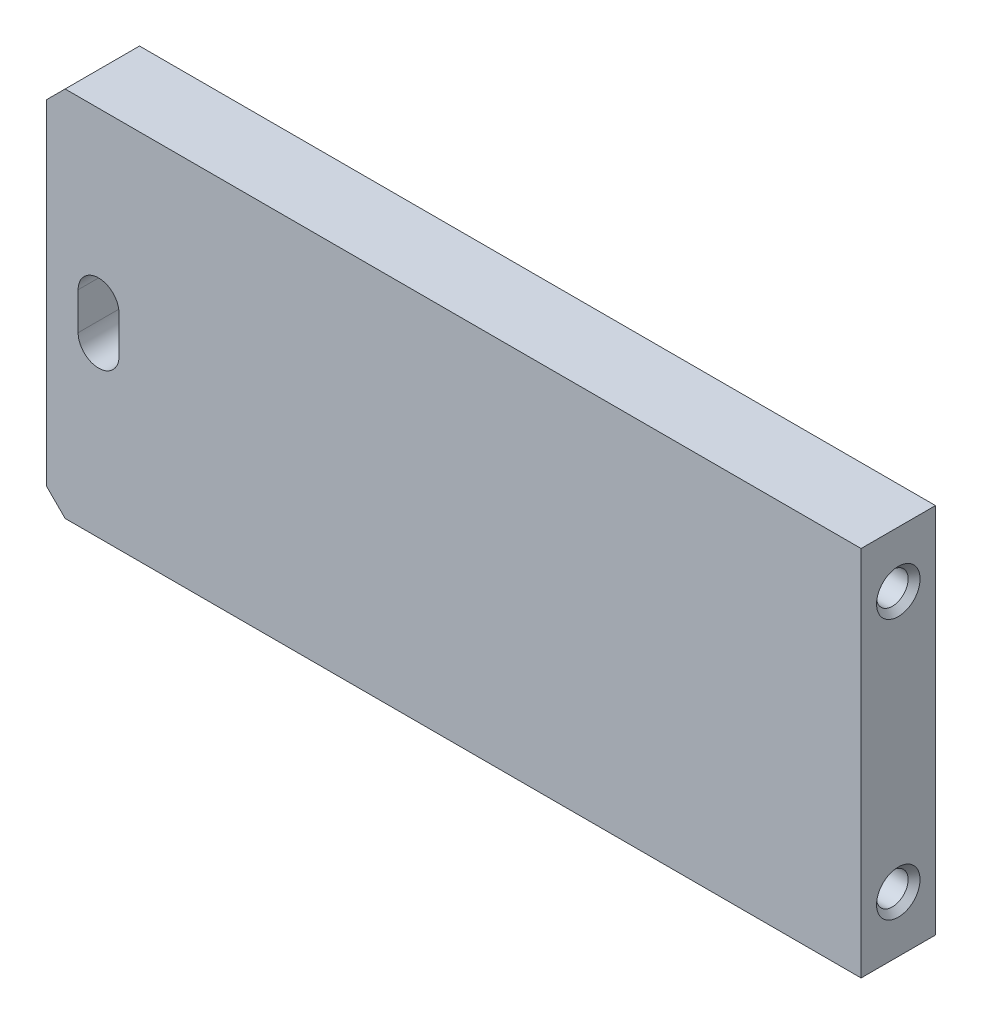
ISO-10303-21;
HEADER;
FILE_DESCRIPTION(('STEP AP214'),'2;1');
FILE_NAME('part.step','',(''),(''),'','','');
FILE_SCHEMA(('AUTOMOTIVE_DESIGN { 1 0 10303 214 1 1 1 1 }'));
ENDSEC;
DATA;
#1=APPLICATION_CONTEXT('core data for automotive mechanical design processes');
#2=APPLICATION_PROTOCOL_DEFINITION('international standard','automotive_design',2000,#1);
#3=PRODUCT_CONTEXT('',#1,'mechanical');
#4=PRODUCT('Part','Part','',(#3));
#5=PRODUCT_RELATED_PRODUCT_CATEGORY('part','',(#4));
#6=PRODUCT_DEFINITION_FORMATION('','',#4);
#7=PRODUCT_DEFINITION_CONTEXT('part definition',#1,'design');
#8=PRODUCT_DEFINITION('design','',#6,#7);
#9=PRODUCT_DEFINITION_SHAPE('','',#8);
#10=(LENGTH_UNIT() NAMED_UNIT(*) SI_UNIT(.MILLI.,.METRE.));
#11=(NAMED_UNIT(*) PLANE_ANGLE_UNIT() SI_UNIT($,.RADIAN.));
#12=(NAMED_UNIT(*) SI_UNIT($,.STERADIAN.) SOLID_ANGLE_UNIT());
#13=UNCERTAINTY_MEASURE_WITH_UNIT(LENGTH_MEASURE(1.E-05),#10,'distance_accuracy_value','');
#14=(GEOMETRIC_REPRESENTATION_CONTEXT(3) GLOBAL_UNCERTAINTY_ASSIGNED_CONTEXT((#13)) GLOBAL_UNIT_ASSIGNED_CONTEXT((#10,
#11,#12)) REPRESENTATION_CONTEXT('',''));
#15=CARTESIAN_POINT('',(0.,0.,0.));
#16=DIRECTION('',(0.,0.,1.));
#17=DIRECTION('',(1.,0.,0.));
#18=AXIS2_PLACEMENT_3D('',#15,#16,#17);
#19=CARTESIAN_POINT('',(2.66453525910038E-12,-2.58126853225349E-12,20.0000000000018));
#20=DIRECTION('',(0.999999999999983,0.,0.));
#21=DIRECTION('',(0.,0.,-1.));
#22=AXIS2_PLACEMENT_3D('',#19,#20,#21);
#23=PLANE('',#22);
#24=CARTESIAN_POINT('',(1.33226762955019E-12,24.9999999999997,10.0000000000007));
#25=DIRECTION('',(0.999999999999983,0.,0.));
#26=DIRECTION('',(0.,0.,-1.));
#27=AXIS2_PLACEMENT_3D('',#24,#25,#26);
#28=CIRCLE('',#27,5.85000000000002);
#29=CARTESIAN_POINT('',(1.33400235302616E-12,24.9999999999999,15.8500000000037));
#30=VERTEX_POINT('',#29);
#31=EDGE_CURVE('E226',#30,#30,#28,.T.);
#32=ORIENTED_EDGE('',*,*,#31,.T.);
#33=EDGE_LOOP('',(#32));
#34=FACE_BOUND('',#33,.T.);
#35=CARTESIAN_POINT('',(3.10862446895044E-12,75.0000000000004,10.0000000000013));
#36=DIRECTION('',(0.999999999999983,0.,0.));
#37=DIRECTION('',(0.,0.,-1.));
#38=AXIS2_PLACEMENT_3D('',#35,#36,#37);
#39=CIRCLE('',#38,5.85000000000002);
#40=CARTESIAN_POINT('',(3.11035919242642E-12,75.,15.8500000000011));
#41=VERTEX_POINT('',#40);
#42=EDGE_CURVE('E223',#41,#41,#39,.T.);
#43=ORIENTED_EDGE('',*,*,#42,.T.);
#44=EDGE_LOOP('',(#43));
#45=FACE_BOUND('',#44,.T.);
#46=DIRECTION('',(0.,-1.00000000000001,0.));
#47=VECTOR('',#46,1.);
#48=CARTESIAN_POINT('',(0.,0.,0.));
#49=LINE('',#48,#47);
#50=CARTESIAN_POINT('',(9.32587340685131E-12,95.0000000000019,3.08086889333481E-12));
#51=VERTEX_POINT('',#50);
#52=CARTESIAN_POINT('',(3.10862446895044E-12,5.00000000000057,7.49400541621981E-13));
#53=VERTEX_POINT('',#52);
#54=EDGE_CURVE('E186',#51,#53,#49,.T.);
#55=ORIENTED_EDGE('',*,*,#54,.T.);
#56=DIRECTION('',(0.,0.,1.));
#57=VECTOR('',#56,1.);
#58=CARTESIAN_POINT('',(-4.44089209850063E-13,5.00000000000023,20.0000000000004));
#59=LINE('',#58,#57);
#60=CARTESIAN_POINT('',(-4.44089209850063E-13,5.00000000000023,20.0000000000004));
#61=VERTEX_POINT('',#60);
#62=EDGE_CURVE('E61',#53,#61,#59,.T.);
#63=ORIENTED_EDGE('',*,*,#62,.T.);
#64=DIRECTION('',(0.,-1.00000000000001,0.));
#65=VECTOR('',#64,1.);
#66=CARTESIAN_POINT('',(2.66453525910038E-12,-2.58126853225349E-12,20.0000000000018));
#67=LINE('',#66,#65);
#68=CARTESIAN_POINT('',(5.32907051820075E-12,95.0000000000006,20.0000000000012));
#69=VERTEX_POINT('',#68);
#70=EDGE_CURVE('E187',#69,#61,#67,.T.);
#71=ORIENTED_EDGE('',*,*,#70,.F.);
#72=DIRECTION('',(0.,0.,-1.));
#73=VECTOR('',#72,1.);
#74=CARTESIAN_POINT('',(5.32907051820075E-12,95.0000000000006,20.0000000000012));
#75=LINE('',#74,#73);
#76=EDGE_CURVE('E239',#69,#51,#75,.T.);
#77=ORIENTED_EDGE('',*,*,#76,.T.);
#78=EDGE_LOOP('',(#55,#63,#71,#77));
#79=FACE_BOUND('',#78,.T.);
#80=ADVANCED_FACE('F40',(#34,#45,#79),#23,.F.);
#81=CARTESIAN_POINT('',(2.66453525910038E-12,-2.58126853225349E-12,20.0000000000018));
#82=DIRECTION('',(0.,1.00000000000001,0.));
#83=DIRECTION('',(0.,0.,1.));
#84=AXIS2_PLACEMENT_3D('',#81,#82,#83);
#85=PLANE('',#84);
#86=DIRECTION('',(0.999999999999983,0.,0.));
#87=VECTOR('',#86,1.);
#88=CARTESIAN_POINT('',(2.66453525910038E-12,-2.58126853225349E-12,20.0000000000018));
#89=LINE('',#88,#87);
#90=CARTESIAN_POINT('',(5.00000000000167,-1.66533453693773E-13,20.0000000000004));
#91=VERTEX_POINT('',#90);
#92=CARTESIAN_POINT('',(219.000000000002,3.33066907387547E-13,20.0000000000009));
#93=VERTEX_POINT('',#92);
#94=EDGE_CURVE('E189',#91,#93,#89,.T.);
#95=ORIENTED_EDGE('',*,*,#94,.F.);
#96=DIRECTION('',(0.,0.,-1.));
#97=VECTOR('',#96,1.);
#98=CARTESIAN_POINT('',(5.00000000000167,-1.66533453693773E-13,20.0000000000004));
#99=LINE('',#98,#97);
#100=CARTESIAN_POINT('',(5.00000000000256,4.16333634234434E-13,8.88178419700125E-13));
#101=VERTEX_POINT('',#100);
#102=EDGE_CURVE('E232',#91,#101,#99,.T.);
#103=ORIENTED_EDGE('',*,*,#102,.T.);
#104=DIRECTION('',(0.999999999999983,0.,0.));
#105=VECTOR('',#104,1.);
#106=CARTESIAN_POINT('',(0.,0.,0.));
#107=LINE('',#106,#105);
#108=CARTESIAN_POINT('',(219.000000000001,-7.0082828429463E-13,1.41553435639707E-12));
#109=VERTEX_POINT('',#108);
#110=EDGE_CURVE('E198',#101,#109,#107,.T.);
#111=ORIENTED_EDGE('',*,*,#110,.T.);
#112=DIRECTION('',(0.,0.,-1.));
#113=VECTOR('',#112,1.);
#114=CARTESIAN_POINT('',(219.000000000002,3.33066907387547E-13,20.0000000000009));
#115=LINE('',#114,#113);
#116=EDGE_CURVE('E205',#93,#109,#115,.T.);
#117=ORIENTED_EDGE('',*,*,#116,.F.);
#118=EDGE_LOOP('',(#95,#103,#111,#117));
#119=FACE_BOUND('',#118,.T.);
#120=ADVANCED_FACE('F250',(#119),#85,.F.);
#121=CARTESIAN_POINT('',(219.000000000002,3.33066907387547E-13,20.0000000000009));
#122=DIRECTION('',(-0.999999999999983,0.,0.));
#123=DIRECTION('',(0.,0.,1.));
#124=AXIS2_PLACEMENT_3D('',#121,#122,#123);
#125=PLANE('',#124);
#126=CARTESIAN_POINT('',(219.,15.0000000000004,10.0000000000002));
#127=DIRECTION('',(-0.999999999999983,0.,0.));
#128=DIRECTION('',(0.,0.,1.));
#129=AXIS2_PLACEMENT_3D('',#126,#127,#128);
#130=CIRCLE('',#129,5.84999999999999);
#131=CARTESIAN_POINT('',(219.,14.9999999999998,4.15000000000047));
#132=VERTEX_POINT('',#131);
#133=EDGE_CURVE('E214',#132,#132,#130,.T.);
#134=ORIENTED_EDGE('',*,*,#133,.T.);
#135=EDGE_LOOP('',(#134));
#136=FACE_BOUND('',#135,.T.);
#137=CARTESIAN_POINT('',(219.000000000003,85.0000000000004,10.0000000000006));
#138=DIRECTION('',(-0.999999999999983,0.,0.));
#139=DIRECTION('',(0.,0.,1.));
#140=AXIS2_PLACEMENT_3D('',#137,#138,#139);
#141=CIRCLE('',#140,5.84999999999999);
#142=CARTESIAN_POINT('',(219.000000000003,85.,4.14999999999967));
#143=VERTEX_POINT('',#142);
#144=EDGE_CURVE('E211',#143,#143,#141,.T.);
#145=ORIENTED_EDGE('',*,*,#144,.T.);
#146=EDGE_LOOP('',(#145));
#147=FACE_BOUND('',#146,.T.);
#148=DIRECTION('',(0.,1.00000000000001,0.));
#149=VECTOR('',#148,1.);
#150=CARTESIAN_POINT('',(219.000000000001,-7.0082828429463E-13,1.41553435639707E-12));
#151=LINE('',#150,#149);
#152=CARTESIAN_POINT('',(219.000000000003,100.,0.));
#153=VERTEX_POINT('',#152);
#154=EDGE_CURVE('E200',#109,#153,#151,.T.);
#155=ORIENTED_EDGE('',*,*,#154,.T.);
#156=DIRECTION('',(0.,0.,-1.));
#157=VECTOR('',#156,1.);
#158=CARTESIAN_POINT('',(219.000000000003,100.000000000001,20.0000000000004));
#159=LINE('',#158,#157);
#160=CARTESIAN_POINT('',(219.000000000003,100.000000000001,20.0000000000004));
#161=VERTEX_POINT('',#160);
#162=EDGE_CURVE('E196',#161,#153,#159,.T.);
#163=ORIENTED_EDGE('',*,*,#162,.F.);
#164=DIRECTION('',(0.,1.00000000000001,0.));
#165=VECTOR('',#164,1.);
#166=CARTESIAN_POINT('',(219.000000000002,3.33066907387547E-13,20.0000000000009));
#167=LINE('',#166,#165);
#168=EDGE_CURVE('E192',#93,#161,#167,.T.);
#169=ORIENTED_EDGE('',*,*,#168,.F.);
#170=ORIENTED_EDGE('',*,*,#116,.T.);
#171=EDGE_LOOP('',(#155,#163,#169,#170));
#172=FACE_BOUND('',#171,.T.);
#173=ADVANCED_FACE('F265',(#136,#147,#172),#125,.F.);
#174=CARTESIAN_POINT('',(5.32907051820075E-12,100.000000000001,20.0000000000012));
#175=DIRECTION('',(0.,-1.00000000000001,0.));
#176=DIRECTION('',(0.,0.,-1.));
#177=AXIS2_PLACEMENT_3D('',#174,#175,#176);
#178=PLANE('',#177);
#179=DIRECTION('',(-0.999999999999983,0.,0.));
#180=VECTOR('',#179,1.);
#181=CARTESIAN_POINT('',(7.105427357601E-12,100.000000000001,8.60422844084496E-13));
#182=LINE('',#181,#180);
#183=CARTESIAN_POINT('',(5.00000000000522,100.,6.66133814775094E-13));
#184=VERTEX_POINT('',#183);
#185=EDGE_CURVE('E190',#153,#184,#182,.T.);
#186=ORIENTED_EDGE('',*,*,#185,.T.);
#187=DIRECTION('',(0.,0.,1.));
#188=VECTOR('',#187,1.);
#189=CARTESIAN_POINT('',(5.00000000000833,100.000000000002,20.000000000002));
#190=LINE('',#189,#188);
#191=CARTESIAN_POINT('',(5.00000000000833,100.000000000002,20.000000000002));
#192=VERTEX_POINT('',#191);
#193=EDGE_CURVE('E11',#184,#192,#190,.T.);
#194=ORIENTED_EDGE('',*,*,#193,.T.);
#195=DIRECTION('',(-0.999999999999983,0.,0.));
#196=VECTOR('',#195,1.);
#197=CARTESIAN_POINT('',(5.32907051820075E-12,100.000000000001,20.0000000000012));
#198=LINE('',#197,#196);
#199=EDGE_CURVE('E194',#161,#192,#198,.T.);
#200=ORIENTED_EDGE('',*,*,#199,.F.);
#201=ORIENTED_EDGE('',*,*,#162,.T.);
#202=EDGE_LOOP('',(#186,#194,#200,#201));
#203=FACE_BOUND('',#202,.T.);
#204=ADVANCED_FACE('F262',(#203),#178,.F.);
#205=CARTESIAN_POINT('',(2.66453525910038E-12,-2.58126853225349E-12,20.0000000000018));
#206=DIRECTION('',(0.,0.,-1.));
#207=DIRECTION('',(-0.999999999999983,0.,0.));
#208=AXIS2_PLACEMENT_3D('',#205,#206,#207);
#209=PLANE('',#208);
#210=DIRECTION('',(0.,1.00000000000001,0.));
#211=VECTOR('',#210,1.);
#212=CARTESIAN_POINT('',(8.50000000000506,55.0000000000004,20.0000000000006));
#213=LINE('',#212,#211);
#214=CARTESIAN_POINT('',(8.50000000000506,44.9999999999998,20.0000000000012));
#215=VERTEX_POINT('',#214);
#216=CARTESIAN_POINT('',(8.50000000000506,55.0000000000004,20.0000000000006));
#217=VERTEX_POINT('',#216);
#218=EDGE_CURVE('E143',#215,#217,#213,.T.);
#219=ORIENTED_EDGE('',*,*,#218,.T.);
#220=CARTESIAN_POINT('',(14.0000000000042,55.0000000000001,20.0000000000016));
#221=DIRECTION('',(0.,0.,-1.));
#222=DIRECTION('',(-0.999999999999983,0.,0.));
#223=AXIS2_PLACEMENT_3D('',#220,#221,#222);
#224=CIRCLE('',#223,5.5);
#225=CARTESIAN_POINT('',(19.5000000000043,54.9999999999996,20.0000000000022));
#226=VERTEX_POINT('',#225);
#227=EDGE_CURVE('E135',#217,#226,#224,.T.);
#228=ORIENTED_EDGE('',*,*,#227,.T.);
#229=DIRECTION('',(0.,-1.00000000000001,0.));
#230=VECTOR('',#229,1.);
#231=CARTESIAN_POINT('',(19.5000000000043,54.9999999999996,20.0000000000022));
#232=LINE('',#231,#230);
#233=CARTESIAN_POINT('',(19.500000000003,44.9999999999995,20.0000000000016));
#234=VERTEX_POINT('',#233);
#235=EDGE_CURVE('E147',#226,#234,#232,.T.);
#236=ORIENTED_EDGE('',*,*,#235,.T.);
#237=CARTESIAN_POINT('',(14.0000000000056,45.0000000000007,20.0000000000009));
#238=DIRECTION('',(0.,0.,-1.));
#239=DIRECTION('',(-0.999999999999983,0.,0.));
#240=AXIS2_PLACEMENT_3D('',#237,#238,#239);
#241=CIRCLE('',#240,5.5);
#242=EDGE_CURVE('E151',#234,#215,#241,.T.);
#243=ORIENTED_EDGE('',*,*,#242,.T.);
#244=EDGE_LOOP('',(#219,#228,#236,#243));
#245=FACE_BOUND('',#244,.T.);
#246=ORIENTED_EDGE('',*,*,#70,.T.);
#247=DIRECTION('',(-0.707106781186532,0.707106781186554,0.));
#248=VECTOR('',#247,1.);
#249=CARTESIAN_POINT('',(5.00000000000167,-1.66533453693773E-13,20.0000000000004));
#250=LINE('',#249,#248);
#251=EDGE_CURVE('E48',#61,#91,#250,.F.);
#252=ORIENTED_EDGE('',*,*,#251,.T.);
#253=ORIENTED_EDGE('',*,*,#94,.T.);
#254=ORIENTED_EDGE('',*,*,#168,.T.);
#255=ORIENTED_EDGE('',*,*,#199,.T.);
#256=DIRECTION('',(0.707106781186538,0.707106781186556,0.));
#257=VECTOR('',#256,1.);
#258=CARTESIAN_POINT('',(5.32907051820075E-12,95.0000000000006,20.0000000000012));
#259=LINE('',#258,#257);
#260=EDGE_CURVE('E243',#192,#69,#259,.F.);
#261=ORIENTED_EDGE('',*,*,#260,.T.);
#262=EDGE_LOOP('',(#246,#252,#253,#254,#255,#261));
#263=FACE_BOUND('',#262,.T.);
#264=ADVANCED_FACE('F153',(#245,#263),#209,.F.);
#265=CARTESIAN_POINT('',(0.,0.,0.));
#266=DIRECTION('',(0.,0.,-1.));
#267=DIRECTION('',(-0.999999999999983,0.,0.));
#268=AXIS2_PLACEMENT_3D('',#265,#266,#267);
#269=PLANE('',#268);
#270=CARTESIAN_POINT('',(14.0000000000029,54.9999999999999,8.60422844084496E-13));
#271=DIRECTION('',(0.,0.,-1.));
#272=DIRECTION('',(-0.999999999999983,0.,0.));
#273=AXIS2_PLACEMENT_3D('',#270,#271,#272);
#274=CIRCLE('',#273,5.5);
#275=CARTESIAN_POINT('',(8.50000000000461,55.0000000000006,7.7715611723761E-13));
#276=VERTEX_POINT('',#275);
#277=CARTESIAN_POINT('',(19.5000000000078,55.0000000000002,2.08166817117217E-12));
#278=VERTEX_POINT('',#277);
#279=EDGE_CURVE('E138',#276,#278,#274,.T.);
#280=ORIENTED_EDGE('',*,*,#279,.F.);
#281=DIRECTION('',(0.,1.00000000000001,0.));
#282=VECTOR('',#281,1.);
#283=CARTESIAN_POINT('',(8.50000000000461,55.0000000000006,7.7715611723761E-13));
#284=LINE('',#283,#282);
#285=CARTESIAN_POINT('',(8.50000000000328,45.0000000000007,1.22124532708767E-12));
#286=VERTEX_POINT('',#285);
#287=EDGE_CURVE('E156',#286,#276,#284,.T.);
#288=ORIENTED_EDGE('',*,*,#287,.F.);
#289=CARTESIAN_POINT('',(14.0000000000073,45.0000000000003,8.88178419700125E-13));
#290=DIRECTION('',(0.,0.,-1.));
#291=DIRECTION('',(-0.999999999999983,0.,0.));
#292=AXIS2_PLACEMENT_3D('',#289,#290,#291);
#293=CIRCLE('',#292,5.5);
#294=CARTESIAN_POINT('',(19.5000000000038,45.0000000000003,4.44089209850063E-13));
#295=VERTEX_POINT('',#294);
#296=EDGE_CURVE('E159',#295,#286,#293,.T.);
#297=ORIENTED_EDGE('',*,*,#296,.F.);
#298=DIRECTION('',(0.,-1.00000000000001,0.));
#299=VECTOR('',#298,1.);
#300=CARTESIAN_POINT('',(19.5000000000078,55.0000000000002,2.08166817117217E-12));
#301=LINE('',#300,#299);
#302=EDGE_CURVE('E165',#278,#295,#301,.T.);
#303=ORIENTED_EDGE('',*,*,#302,.F.);
#304=EDGE_LOOP('',(#280,#288,#297,#303));
#305=FACE_BOUND('',#304,.T.);
#306=ORIENTED_EDGE('',*,*,#110,.F.);
#307=DIRECTION('',(0.707106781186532,-0.707106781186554,0.));
#308=VECTOR('',#307,1.);
#309=CARTESIAN_POINT('',(2.50000000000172,2.49999999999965,1.11022302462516E-12));
#310=LINE('',#309,#308);
#311=EDGE_CURVE('E237',#101,#53,#310,.F.);
#312=ORIENTED_EDGE('',*,*,#311,.T.);
#313=ORIENTED_EDGE('',*,*,#54,.F.);
#314=DIRECTION('',(-0.707106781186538,-0.707106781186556,0.));
#315=VECTOR('',#314,1.);
#316=CARTESIAN_POINT('',(-47.4999999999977,47.5,9.71445146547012E-13));
#317=LINE('',#316,#315);
#318=EDGE_CURVE('E235',#51,#184,#317,.F.);
#319=ORIENTED_EDGE('',*,*,#318,.T.);
#320=ORIENTED_EDGE('',*,*,#185,.F.);
#321=ORIENTED_EDGE('',*,*,#154,.F.);
#322=EDGE_LOOP('',(#306,#312,#313,#319,#320,#321));
#323=FACE_BOUND('',#322,.T.);
#324=ADVANCED_FACE('F256',(#305,#323),#269,.T.);
#325=CARTESIAN_POINT('',(193.,15.0000000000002,9.99999999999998));
#326=DIRECTION('',(0.999999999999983,0.,0.));
#327=DIRECTION('',(0.,0.,-1.));
#328=AXIS2_PLACEMENT_3D('',#325,#326,#327);
#329=CONICAL_SURFACE('',#328,4.24999999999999,1.02974425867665);
#330=CARTESIAN_POINT('',(190.446342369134,15.0000000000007,10.0000000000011));
#331=VERTEX_POINT('',#330);
#332=VERTEX_LOOP('',#331);
#333=FACE_BOUND('',#332,.T.);
#334=CARTESIAN_POINT('',(193.,15.0000000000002,9.99999999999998));
#335=DIRECTION('',(0.999999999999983,0.,0.));
#336=DIRECTION('',(0.,0.,-1.));
#337=AXIS2_PLACEMENT_3D('',#334,#335,#336);
#338=CIRCLE('',#337,4.24999999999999);
#339=CARTESIAN_POINT('',(193.,15.0000000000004,5.75000000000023));
#340=VERTEX_POINT('',#339);
#341=EDGE_CURVE('E183',#340,#340,#338,.T.);
#342=ORIENTED_EDGE('',*,*,#341,.T.);
#343=EDGE_LOOP('',(#342));
#344=FACE_BOUND('',#343,.T.);
#345=ADVANCED_FACE('F342',(#333,#344),#329,.F.);
#346=CARTESIAN_POINT('',(219.,15.0000000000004,10.0000000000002));
#347=DIRECTION('',(0.999999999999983,0.,0.));
#348=DIRECTION('',(0.,0.,-1.));
#349=AXIS2_PLACEMENT_3D('',#346,#347,#348);
#350=CYLINDRICAL_SURFACE('',#349,4.24999999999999);
#351=CARTESIAN_POINT('',(217.400000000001,14.9999999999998,9.99999999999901));
#352=DIRECTION('',(-0.999999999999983,0.,0.));
#353=DIRECTION('',(0.,0.,1.));
#354=AXIS2_PLACEMENT_3D('',#351,#352,#353);
#355=CIRCLE('',#354,4.24999999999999);
#356=CARTESIAN_POINT('',(217.400000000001,15.0000000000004,5.75000000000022));
#357=VERTEX_POINT('',#356);
#358=EDGE_CURVE('E208',#357,#357,#355,.F.);
#359=CARTESIAN_POINT('',(217.400000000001,15.0000000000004,5.75000000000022));
#360=CARTESIAN_POINT('',(217.145833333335,15.0000000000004,5.75000000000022));
#361=CARTESIAN_POINT('',(216.891666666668,15.0000000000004,5.75000000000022));
#362=CARTESIAN_POINT('',(216.383333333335,15.0000000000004,5.75000000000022));
#363=CARTESIAN_POINT('',(216.129166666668,15.0000000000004,5.75000000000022));
#364=CARTESIAN_POINT('',(215.620833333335,15.0000000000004,5.75000000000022));
#365=CARTESIAN_POINT('',(215.366666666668,15.0000000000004,5.75000000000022));
#366=CARTESIAN_POINT('',(214.858333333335,15.0000000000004,5.75000000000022));
#367=CARTESIAN_POINT('',(214.604166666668,15.0000000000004,5.75000000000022));
#368=CARTESIAN_POINT('',(214.095833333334,15.0000000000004,5.75000000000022));
#369=CARTESIAN_POINT('',(213.841666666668,15.0000000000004,5.75000000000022));
#370=CARTESIAN_POINT('',(213.333333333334,15.0000000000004,5.75000000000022));
#371=CARTESIAN_POINT('',(213.079166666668,15.0000000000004,5.75000000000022));
#372=CARTESIAN_POINT('',(212.570833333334,15.0000000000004,5.75000000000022));
#373=CARTESIAN_POINT('',(212.316666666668,15.0000000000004,5.75000000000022));
#374=CARTESIAN_POINT('',(211.808333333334,15.0000000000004,5.75000000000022));
#375=CARTESIAN_POINT('',(211.554166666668,15.0000000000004,5.75000000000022));
#376=CARTESIAN_POINT('',(211.045833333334,15.0000000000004,5.75000000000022));
#377=CARTESIAN_POINT('',(210.791666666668,15.0000000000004,5.75000000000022));
#378=CARTESIAN_POINT('',(210.283333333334,15.0000000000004,5.75000000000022));
#379=CARTESIAN_POINT('',(210.029166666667,15.0000000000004,5.75000000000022));
#380=CARTESIAN_POINT('',(209.520833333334,15.0000000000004,5.75000000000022));
#381=CARTESIAN_POINT('',(209.266666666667,15.0000000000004,5.75000000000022));
#382=CARTESIAN_POINT('',(208.758333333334,15.0000000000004,5.75000000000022));
#383=CARTESIAN_POINT('',(208.504166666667,15.0000000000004,5.75000000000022));
#384=CARTESIAN_POINT('',(207.995833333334,15.0000000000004,5.75000000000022));
#385=CARTESIAN_POINT('',(207.741666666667,15.0000000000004,5.75000000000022));
#386=CARTESIAN_POINT('',(207.233333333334,15.0000000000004,5.75000000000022));
#387=CARTESIAN_POINT('',(206.979166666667,15.0000000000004,5.75000000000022));
#388=CARTESIAN_POINT('',(206.470833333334,15.0000000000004,5.75000000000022));
#389=CARTESIAN_POINT('',(206.216666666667,15.0000000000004,5.75000000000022));
#390=CARTESIAN_POINT('',(205.708333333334,15.0000000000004,5.75000000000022));
#391=CARTESIAN_POINT('',(205.454166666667,15.0000000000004,5.75000000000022));
#392=CARTESIAN_POINT('',(204.945833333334,15.0000000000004,5.75000000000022));
#393=CARTESIAN_POINT('',(204.691666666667,15.0000000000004,5.75000000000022));
#394=CARTESIAN_POINT('',(204.183333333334,15.0000000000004,5.75000000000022));
#395=CARTESIAN_POINT('',(203.929166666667,15.0000000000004,5.75000000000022));
#396=CARTESIAN_POINT('',(203.420833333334,15.0000000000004,5.75000000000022));
#397=CARTESIAN_POINT('',(203.166666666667,15.0000000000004,5.75000000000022));
#398=CARTESIAN_POINT('',(202.658333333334,15.0000000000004,5.75000000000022));
#399=CARTESIAN_POINT('',(202.404166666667,15.0000000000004,5.75000000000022));
#400=CARTESIAN_POINT('',(201.895833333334,15.0000000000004,5.75000000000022));
#401=CARTESIAN_POINT('',(201.641666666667,15.0000000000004,5.75000000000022));
#402=CARTESIAN_POINT('',(201.133333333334,15.0000000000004,5.75000000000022));
#403=CARTESIAN_POINT('',(200.879166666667,15.0000000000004,5.75000000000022));
#404=CARTESIAN_POINT('',(200.370833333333,15.0000000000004,5.75000000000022));
#405=CARTESIAN_POINT('',(200.116666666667,15.0000000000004,5.75000000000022));
#406=CARTESIAN_POINT('',(199.608333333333,15.0000000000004,5.75000000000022));
#407=CARTESIAN_POINT('',(199.354166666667,15.0000000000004,5.75000000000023));
#408=CARTESIAN_POINT('',(198.845833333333,15.0000000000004,5.75000000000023));
#409=CARTESIAN_POINT('',(198.591666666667,15.0000000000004,5.75000000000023));
#410=CARTESIAN_POINT('',(198.083333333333,15.0000000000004,5.75000000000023));
#411=CARTESIAN_POINT('',(197.829166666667,15.0000000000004,5.75000000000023));
#412=CARTESIAN_POINT('',(197.320833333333,15.0000000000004,5.75000000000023));
#413=CARTESIAN_POINT('',(197.066666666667,15.0000000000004,5.75000000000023));
#414=CARTESIAN_POINT('',(196.558333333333,15.0000000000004,5.75000000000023));
#415=CARTESIAN_POINT('',(196.304166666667,15.0000000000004,5.75000000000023));
#416=CARTESIAN_POINT('',(195.795833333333,15.0000000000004,5.75000000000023));
#417=CARTESIAN_POINT('',(195.541666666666,15.0000000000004,5.75000000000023));
#418=CARTESIAN_POINT('',(195.033333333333,15.0000000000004,5.75000000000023));
#419=CARTESIAN_POINT('',(194.779166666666,15.0000000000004,5.75000000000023));
#420=CARTESIAN_POINT('',(194.270833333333,15.0000000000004,5.75000000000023));
#421=CARTESIAN_POINT('',(194.016666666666,15.0000000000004,5.75000000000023));
#422=CARTESIAN_POINT('',(193.508333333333,15.0000000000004,5.75000000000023));
#423=CARTESIAN_POINT('',(193.254166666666,15.0000000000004,5.75000000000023));
#424=CARTESIAN_POINT('',(193.,15.0000000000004,5.75000000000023));
#425=B_SPLINE_CURVE_WITH_KNOTS('',3,(#359,#360,#361,#362,#363,#364,#365,#366,#367,#368,#369,
#370,#371,#372,#373,#374,#375,#376,#377,#378,#379,#380,#381,#382,#383,#384,#385,#386,#387,#388,
#389,#390,#391,#392,#393,#394,#395,#396,#397,#398,#399,#400,#401,#402,#403,#404,#405,#406,#407,
#408,#409,#410,#411,#412,#413,#414,#415,#416,#417,#418,#419,#420,#421,#422,#423,#424),
.UNSPECIFIED.,.F.,.F.,(4,2,2,2,2,2,2,2,2,2,2,2,2,2,2,2,2,2,2,2,2,2,2,2,2,2,2,2,2,2,2,2,4),(0.,
0.762500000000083,1.52500000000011,2.28750000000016,3.05000000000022,3.81250000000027,
4.57500000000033,5.33750000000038,6.10000000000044,6.86250000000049,7.62500000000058,
8.3875000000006,9.15000000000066,9.91250000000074,10.6750000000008,11.4375000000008,
12.2000000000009,12.9625000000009,13.725000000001,14.487500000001,15.2500000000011,
16.0125000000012,16.7750000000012,17.5375000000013,18.3000000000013,19.0625000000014,
19.8250000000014,20.5875000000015,21.3500000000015,22.1125000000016,22.8750000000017,
23.6375000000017,24.4000000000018),.UNSPECIFIED.);
#426=EDGE_CURVE('BSEAM338',#357,#340,#425,.T.);
#427=ORIENTED_EDGE('',*,*,#358,.T.);
#428=ORIENTED_EDGE('',*,*,#341,.F.);
#429=ORIENTED_EDGE('',*,*,#426,.T.);
#430=ORIENTED_EDGE('',*,*,#426,.F.);
#431=EDGE_LOOP('',(#427,#429,#428,#430));
#432=FACE_BOUND('',#431,.T.);
#433=ADVANCED_FACE('F338',(#432),#350,.F.);
#434=CARTESIAN_POINT('',(193.000000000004,85.0000000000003,10.0000000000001));
#435=DIRECTION('',(0.999999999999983,0.,0.));
#436=DIRECTION('',(0.,0.,-1.));
#437=AXIS2_PLACEMENT_3D('',#434,#435,#436);
#438=CONICAL_SURFACE('',#437,4.24999999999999,1.02974425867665);
#439=CARTESIAN_POINT('',(190.446342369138,85.0000000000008,10.0000000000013));
#440=VERTEX_POINT('',#439);
#441=VERTEX_LOOP('',#440);
#442=FACE_BOUND('',#441,.T.);
#443=CARTESIAN_POINT('',(193.000000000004,85.0000000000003,10.0000000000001));
#444=DIRECTION('',(0.999999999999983,0.,0.));
#445=DIRECTION('',(0.,0.,-1.));
#446=AXIS2_PLACEMENT_3D('',#443,#444,#445);
#447=CIRCLE('',#446,4.24999999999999);
#448=CARTESIAN_POINT('',(193.000000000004,85.0000000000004,5.75000000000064));
#449=VERTEX_POINT('',#448);
#450=EDGE_CURVE('E180',#449,#449,#447,.T.);
#451=ORIENTED_EDGE('',*,*,#450,.T.);
#452=EDGE_LOOP('',(#451));
#453=FACE_BOUND('',#452,.T.);
#454=ADVANCED_FACE('F334',(#442,#453),#438,.F.);
#455=CARTESIAN_POINT('',(219.000000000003,85.0000000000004,10.0000000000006));
#456=DIRECTION('',(0.999999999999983,0.,0.));
#457=DIRECTION('',(0.,0.,-1.));
#458=AXIS2_PLACEMENT_3D('',#455,#456,#457);
#459=CYLINDRICAL_SURFACE('',#458,4.24999999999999);
#460=CARTESIAN_POINT('',(217.400000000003,85.,9.99999999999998));
#461=DIRECTION('',(-0.999999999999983,0.,0.));
#462=DIRECTION('',(0.,0.,1.));
#463=AXIS2_PLACEMENT_3D('',#460,#461,#462);
#464=CIRCLE('',#463,4.24999999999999);
#465=CARTESIAN_POINT('',(217.400000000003,85.0000000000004,5.75000000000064));
#466=VERTEX_POINT('',#465);
#467=EDGE_CURVE('E217',#466,#466,#464,.F.);
#468=CARTESIAN_POINT('',(217.400000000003,85.0000000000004,5.75000000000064));
#469=CARTESIAN_POINT('',(217.145833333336,85.0000000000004,5.75000000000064));
#470=CARTESIAN_POINT('',(216.89166666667,85.0000000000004,5.75000000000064));
#471=CARTESIAN_POINT('',(216.383333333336,85.0000000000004,5.75000000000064));
#472=CARTESIAN_POINT('',(216.12916666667,85.0000000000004,5.75000000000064));
#473=CARTESIAN_POINT('',(215.620833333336,85.0000000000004,5.75000000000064));
#474=CARTESIAN_POINT('',(215.36666666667,85.0000000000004,5.75000000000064));
#475=CARTESIAN_POINT('',(214.858333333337,85.0000000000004,5.75000000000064));
#476=CARTESIAN_POINT('',(214.60416666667,85.0000000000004,5.75000000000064));
#477=CARTESIAN_POINT('',(214.095833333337,85.0000000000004,5.75000000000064));
#478=CARTESIAN_POINT('',(213.84166666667,85.0000000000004,5.75000000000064));
#479=CARTESIAN_POINT('',(213.333333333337,85.0000000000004,5.75000000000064));
#480=CARTESIAN_POINT('',(213.07916666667,85.0000000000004,5.75000000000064));
#481=CARTESIAN_POINT('',(212.570833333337,85.0000000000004,5.75000000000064));
#482=CARTESIAN_POINT('',(212.31666666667,85.0000000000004,5.75000000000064));
#483=CARTESIAN_POINT('',(211.808333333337,85.0000000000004,5.75000000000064));
#484=CARTESIAN_POINT('',(211.55416666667,85.0000000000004,5.75000000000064));
#485=CARTESIAN_POINT('',(211.045833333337,85.0000000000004,5.75000000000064));
#486=CARTESIAN_POINT('',(210.79166666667,85.0000000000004,5.75000000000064));
#487=CARTESIAN_POINT('',(210.283333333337,85.0000000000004,5.75000000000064));
#488=CARTESIAN_POINT('',(210.02916666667,85.0000000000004,5.75000000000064));
#489=CARTESIAN_POINT('',(209.520833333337,85.0000000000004,5.75000000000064));
#490=CARTESIAN_POINT('',(209.26666666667,85.0000000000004,5.75000000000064));
#491=CARTESIAN_POINT('',(208.758333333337,85.0000000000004,5.75000000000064));
#492=CARTESIAN_POINT('',(208.50416666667,85.0000000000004,5.75000000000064));
#493=CARTESIAN_POINT('',(207.995833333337,85.0000000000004,5.75000000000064));
#494=CARTESIAN_POINT('',(207.74166666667,85.0000000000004,5.75000000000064));
#495=CARTESIAN_POINT('',(207.233333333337,85.0000000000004,5.75000000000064));
#496=CARTESIAN_POINT('',(206.97916666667,85.0000000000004,5.75000000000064));
#497=CARTESIAN_POINT('',(206.470833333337,85.0000000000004,5.75000000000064));
#498=CARTESIAN_POINT('',(206.21666666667,85.0000000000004,5.75000000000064));
#499=CARTESIAN_POINT('',(205.708333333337,85.0000000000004,5.75000000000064));
#500=CARTESIAN_POINT('',(205.45416666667,85.0000000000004,5.75000000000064));
#501=CARTESIAN_POINT('',(204.945833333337,85.0000000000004,5.75000000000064));
#502=CARTESIAN_POINT('',(204.69166666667,85.0000000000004,5.75000000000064));
#503=CARTESIAN_POINT('',(204.183333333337,85.0000000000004,5.75000000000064));
#504=CARTESIAN_POINT('',(203.92916666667,85.0000000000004,5.75000000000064));
#505=CARTESIAN_POINT('',(203.420833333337,85.0000000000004,5.75000000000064));
#506=CARTESIAN_POINT('',(203.16666666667,85.0000000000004,5.75000000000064));
#507=CARTESIAN_POINT('',(202.658333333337,85.0000000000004,5.75000000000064));
#508=CARTESIAN_POINT('',(202.40416666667,85.0000000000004,5.75000000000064));
#509=CARTESIAN_POINT('',(201.895833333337,85.0000000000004,5.75000000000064));
#510=CARTESIAN_POINT('',(201.64166666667,85.0000000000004,5.75000000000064));
#511=CARTESIAN_POINT('',(201.133333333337,85.0000000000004,5.75000000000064));
#512=CARTESIAN_POINT('',(200.87916666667,85.0000000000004,5.75000000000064));
#513=CARTESIAN_POINT('',(200.370833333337,85.0000000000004,5.75000000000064));
#514=CARTESIAN_POINT('',(200.11666666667,85.0000000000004,5.75000000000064));
#515=CARTESIAN_POINT('',(199.608333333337,85.0000000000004,5.75000000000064));
#516=CARTESIAN_POINT('',(199.35416666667,85.0000000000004,5.75000000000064));
#517=CARTESIAN_POINT('',(198.845833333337,85.0000000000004,5.75000000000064));
#518=CARTESIAN_POINT('',(198.59166666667,85.0000000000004,5.75000000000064));
#519=CARTESIAN_POINT('',(198.083333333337,85.0000000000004,5.75000000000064));
#520=CARTESIAN_POINT('',(197.82916666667,85.0000000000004,5.75000000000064));
#521=CARTESIAN_POINT('',(197.320833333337,85.0000000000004,5.75000000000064));
#522=CARTESIAN_POINT('',(197.06666666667,85.0000000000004,5.75000000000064));
#523=CARTESIAN_POINT('',(196.558333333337,85.0000000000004,5.75000000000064));
#524=CARTESIAN_POINT('',(196.30416666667,85.0000000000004,5.75000000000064));
#525=CARTESIAN_POINT('',(195.795833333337,85.0000000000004,5.75000000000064));
#526=CARTESIAN_POINT('',(195.54166666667,85.0000000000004,5.75000000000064));
#527=CARTESIAN_POINT('',(195.033333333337,85.0000000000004,5.75000000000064));
#528=CARTESIAN_POINT('',(194.77916666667,85.0000000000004,5.75000000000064));
#529=CARTESIAN_POINT('',(194.270833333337,85.0000000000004,5.75000000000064));
#530=CARTESIAN_POINT('',(194.01666666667,85.0000000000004,5.75000000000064));
#531=CARTESIAN_POINT('',(193.508333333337,85.0000000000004,5.75000000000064));
#532=CARTESIAN_POINT('',(193.25416666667,85.0000000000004,5.75000000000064));
#533=CARTESIAN_POINT('',(193.000000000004,85.0000000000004,5.75000000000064));
#534=B_SPLINE_CURVE_WITH_KNOTS('',3,(#468,#469,#470,#471,#472,#473,#474,#475,#476,#477,#478,
#479,#480,#481,#482,#483,#484,#485,#486,#487,#488,#489,#490,#491,#492,#493,#494,#495,#496,#497,
#498,#499,#500,#501,#502,#503,#504,#505,#506,#507,#508,#509,#510,#511,#512,#513,#514,#515,#516,
#517,#518,#519,#520,#521,#522,#523,#524,#525,#526,#527,#528,#529,#530,#531,#532,#533),
.UNSPECIFIED.,.F.,.F.,(4,2,2,2,2,2,2,2,2,2,2,2,2,2,2,2,2,2,2,2,2,2,2,2,2,2,2,2,2,2,2,2,4),(0.,
0.762499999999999,1.525,2.28749999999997,3.04999999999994,3.81249999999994,4.57499999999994,
5.33749999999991,6.09999999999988,6.86249999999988,7.62499999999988,8.38749999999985,
9.14999999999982,9.91249999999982,10.6749999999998,11.4374999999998,12.1999999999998,
12.9624999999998,13.7249999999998,14.4874999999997,15.2499999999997,16.0124999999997,
16.7749999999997,17.5374999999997,18.2999999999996,19.0624999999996,19.8249999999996,
20.5874999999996,21.3499999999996,22.1124999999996,22.8749999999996,23.6374999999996,
24.3999999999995),.UNSPECIFIED.);
#535=EDGE_CURVE('BSEAM287',#466,#449,#534,.T.);
#536=ORIENTED_EDGE('',*,*,#467,.T.);
#537=ORIENTED_EDGE('',*,*,#450,.F.);
#538=ORIENTED_EDGE('',*,*,#535,.T.);
#539=ORIENTED_EDGE('',*,*,#535,.F.);
#540=EDGE_LOOP('',(#536,#538,#537,#539));
#541=FACE_BOUND('',#540,.T.);
#542=ADVANCED_FACE('F287',(#541),#459,.F.);
#543=CARTESIAN_POINT('',(217.400000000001,14.9999999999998,9.99999999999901));
#544=DIRECTION('',(0.999999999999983,0.,0.));
#545=DIRECTION('',(0.,0.,-1.));
#546=AXIS2_PLACEMENT_3D('',#543,#544,#545);
#547=CONICAL_SURFACE('',#546,4.24999999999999,0.785398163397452);
#548=CARTESIAN_POINT('',(219.,14.9999999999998,4.15000000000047));
#549=CARTESIAN_POINT('',(218.983333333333,14.9999999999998,4.16666666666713));
#550=CARTESIAN_POINT('',(218.966666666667,14.9999999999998,4.18333333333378));
#551=CARTESIAN_POINT('',(218.933333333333,14.9999999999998,4.21666666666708));
#552=CARTESIAN_POINT('',(218.916666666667,14.9999999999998,4.23333333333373));
#553=CARTESIAN_POINT('',(218.883333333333,14.9999999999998,4.26666666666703));
#554=CARTESIAN_POINT('',(218.866666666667,14.9999999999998,4.28333333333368));
#555=CARTESIAN_POINT('',(218.833333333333,14.9999999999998,4.31666666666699));
#556=CARTESIAN_POINT('',(218.816666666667,14.9999999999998,4.33333333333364));
#557=CARTESIAN_POINT('',(218.783333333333,14.9999999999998,4.36666666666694));
#558=CARTESIAN_POINT('',(218.766666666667,14.9999999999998,4.38333333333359));
#559=CARTESIAN_POINT('',(218.733333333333,14.9999999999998,4.41666666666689));
#560=CARTESIAN_POINT('',(218.716666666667,14.9999999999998,4.43333333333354));
#561=CARTESIAN_POINT('',(218.683333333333,14.9999999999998,4.46666666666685));
#562=CARTESIAN_POINT('',(218.666666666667,14.9999999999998,4.4833333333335));
#563=CARTESIAN_POINT('',(218.633333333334,14.9999999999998,4.51666666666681));
#564=CARTESIAN_POINT('',(218.616666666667,14.9999999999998,4.53333333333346));
#565=CARTESIAN_POINT('',(218.583333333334,14.9999999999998,4.56666666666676));
#566=CARTESIAN_POINT('',(218.566666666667,14.9999999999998,4.58333333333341));
#567=CARTESIAN_POINT('',(218.533333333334,14.9999999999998,4.61666666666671));
#568=CARTESIAN_POINT('',(218.516666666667,14.9999999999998,4.63333333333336));
#569=CARTESIAN_POINT('',(218.483333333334,14.9999999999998,4.66666666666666));
#570=CARTESIAN_POINT('',(218.466666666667,14.9999999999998,4.68333333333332));
#571=CARTESIAN_POINT('',(218.433333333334,14.9999999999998,4.71666666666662));
#572=CARTESIAN_POINT('',(218.416666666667,14.9999999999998,4.73333333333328));
#573=CARTESIAN_POINT('',(218.383333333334,14.9999999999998,4.76666666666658));
#574=CARTESIAN_POINT('',(218.366666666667,14.9999999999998,4.78333333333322));
#575=CARTESIAN_POINT('',(218.333333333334,14.9999999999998,4.81666666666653));
#576=CARTESIAN_POINT('',(218.316666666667,14.9999999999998,4.83333333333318));
#577=CARTESIAN_POINT('',(218.283333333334,14.9999999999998,4.86666666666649));
#578=CARTESIAN_POINT('',(218.266666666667,14.9999999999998,4.88333333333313));
#579=CARTESIAN_POINT('',(218.233333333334,14.9999999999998,4.91666666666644));
#580=CARTESIAN_POINT('',(218.216666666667,14.9999999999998,4.93333333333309));
#581=CARTESIAN_POINT('',(218.183333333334,14.9999999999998,4.9666666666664));
#582=CARTESIAN_POINT('',(218.166666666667,14.9999999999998,4.98333333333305));
#583=CARTESIAN_POINT('',(218.133333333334,14.9999999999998,5.01666666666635));
#584=CARTESIAN_POINT('',(218.116666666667,14.9999999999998,5.033333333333));
#585=CARTESIAN_POINT('',(218.083333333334,14.9999999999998,5.0666666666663));
#586=CARTESIAN_POINT('',(218.066666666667,14.9999999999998,5.08333333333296));
#587=CARTESIAN_POINT('',(218.033333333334,14.9999999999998,5.11666666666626));
#588=CARTESIAN_POINT('',(218.016666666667,14.9999999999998,5.13333333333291));
#589=CARTESIAN_POINT('',(217.983333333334,14.9999999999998,5.16666666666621));
#590=CARTESIAN_POINT('',(217.966666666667,14.9999999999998,5.18333333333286));
#591=CARTESIAN_POINT('',(217.933333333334,14.9999999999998,5.21666666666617));
#592=CARTESIAN_POINT('',(217.916666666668,14.9999999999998,5.23333333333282));
#593=CARTESIAN_POINT('',(217.883333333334,14.9999999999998,5.26666666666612));
#594=CARTESIAN_POINT('',(217.866666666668,14.9999999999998,5.28333333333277));
#595=CARTESIAN_POINT('',(217.833333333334,14.9999999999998,5.31666666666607));
#596=CARTESIAN_POINT('',(217.816666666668,14.9999999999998,5.33333333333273));
#597=CARTESIAN_POINT('',(217.783333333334,14.9999999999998,5.36666666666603));
#598=CARTESIAN_POINT('',(217.766666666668,14.9999999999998,5.38333333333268));
#599=CARTESIAN_POINT('',(217.733333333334,14.9999999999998,5.41666666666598));
#600=CARTESIAN_POINT('',(217.716666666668,14.9999999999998,5.43333333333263));
#601=CARTESIAN_POINT('',(217.683333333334,14.9999999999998,5.46666666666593));
#602=CARTESIAN_POINT('',(217.666666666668,14.9999999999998,5.48333333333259));
#603=CARTESIAN_POINT('',(217.633333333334,14.9999999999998,5.51666666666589));
#604=CARTESIAN_POINT('',(217.616666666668,14.9999999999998,5.53333333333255));
#605=CARTESIAN_POINT('',(217.583333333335,14.9999999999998,5.56666666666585));
#606=CARTESIAN_POINT('',(217.566666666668,14.9999999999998,5.58333333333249));
#607=CARTESIAN_POINT('',(217.533333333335,14.9999999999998,5.6166666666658));
#608=CARTESIAN_POINT('',(217.516666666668,14.9999999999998,5.63333333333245));
#609=CARTESIAN_POINT('',(217.483333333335,14.9999999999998,5.66666666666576));
#610=CARTESIAN_POINT('',(217.466666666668,14.9999999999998,5.68333333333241));
#611=CARTESIAN_POINT('',(217.433333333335,14.9999999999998,5.7166666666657));
#612=CARTESIAN_POINT('',(217.416666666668,14.9999999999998,5.73333333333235));
#613=CARTESIAN_POINT('',(217.400000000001,14.9999999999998,5.74999999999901));
#614=B_SPLINE_CURVE_WITH_KNOTS('',3,(#548,#549,#550,#551,#552,#553,#554,#555,#556,#557,#558,
#559,#560,#561,#562,#563,#564,#565,#566,#567,#568,#569,#570,#571,#572,#573,#574,#575,#576,#577,
#578,#579,#580,#581,#582,#583,#584,#585,#586,#587,#588,#589,#590,#591,#592,#593,#594,#595,#596,
#597,#598,#599,#600,#601,#602,#603,#604,#605,#606,#607,#608,#609,#610,#611,#612,#613),
.UNSPECIFIED.,.F.,.F.,(4,2,2,2,2,2,2,2,2,2,2,2,2,2,2,2,2,2,2,2,2,2,2,2,2,2,2,2,2,2,2,2,4),(0.,
0.0707106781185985,0.141421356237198,0.212132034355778,0.282842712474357,0.353553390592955,
0.424264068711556,0.494974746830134,0.565685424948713,0.636396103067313,0.707106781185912,
0.77781745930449,0.84852813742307,0.919238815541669,0.989949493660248,1.06066017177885,
1.13137084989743,1.20208152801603,1.27279220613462,1.3435028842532,1.4142135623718,
1.48492424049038,1.55563491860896,1.62634559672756,1.69705627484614,1.76776695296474,
1.83847763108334,1.90918830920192,1.9798989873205,2.0506096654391,2.12132034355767,
2.19203102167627,2.26274169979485),.UNSPECIFIED.);
#615=EDGE_CURVE('BSEAM283',#132,#357,#614,.T.);
#616=ORIENTED_EDGE('',*,*,#133,.F.);
#617=ORIENTED_EDGE('',*,*,#358,.F.);
#618=ORIENTED_EDGE('',*,*,#615,.T.);
#619=ORIENTED_EDGE('',*,*,#615,.F.);
#620=EDGE_LOOP('',(#616,#618,#617,#619));
#621=FACE_BOUND('',#620,.T.);
#622=ADVANCED_FACE('F283',(#621),#547,.F.);
#623=CARTESIAN_POINT('',(217.400000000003,85.,9.99999999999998));
#624=DIRECTION('',(0.999999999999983,0.,0.));
#625=DIRECTION('',(0.,0.,-1.));
#626=AXIS2_PLACEMENT_3D('',#623,#624,#625);
#627=CONICAL_SURFACE('',#626,4.24999999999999,0.785398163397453);
#628=CARTESIAN_POINT('',(219.000000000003,85.,4.14999999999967));
#629=CARTESIAN_POINT('',(218.983333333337,85.,4.16666666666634));
#630=CARTESIAN_POINT('',(218.96666666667,85.,4.18333333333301));
#631=CARTESIAN_POINT('',(218.933333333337,85.,4.21666666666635));
#632=CARTESIAN_POINT('',(218.91666666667,85.,4.23333333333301));
#633=CARTESIAN_POINT('',(218.883333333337,85.,4.26666666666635));
#634=CARTESIAN_POINT('',(218.86666666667,85.,4.28333333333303));
#635=CARTESIAN_POINT('',(218.833333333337,85.,4.31666666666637));
#636=CARTESIAN_POINT('',(218.81666666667,85.,4.33333333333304));
#637=CARTESIAN_POINT('',(218.783333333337,85.,4.36666666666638));
#638=CARTESIAN_POINT('',(218.76666666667,85.,4.38333333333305));
#639=CARTESIAN_POINT('',(218.733333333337,85.,4.41666666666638));
#640=CARTESIAN_POINT('',(218.71666666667,85.,4.43333333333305));
#641=CARTESIAN_POINT('',(218.683333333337,85.,4.4666666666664));
#642=CARTESIAN_POINT('',(218.66666666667,85.,4.48333333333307));
#643=CARTESIAN_POINT('',(218.633333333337,85.,4.51666666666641));
#644=CARTESIAN_POINT('',(218.61666666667,85.,4.53333333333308));
#645=CARTESIAN_POINT('',(218.583333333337,85.,4.56666666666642));
#646=CARTESIAN_POINT('',(218.56666666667,85.,4.58333333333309));
#647=CARTESIAN_POINT('',(218.533333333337,85.,4.61666666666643));
#648=CARTESIAN_POINT('',(218.51666666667,85.,4.63333333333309));
#649=CARTESIAN_POINT('',(218.483333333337,85.,4.66666666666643));
#650=CARTESIAN_POINT('',(218.46666666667,85.,4.68333333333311));
#651=CARTESIAN_POINT('',(218.433333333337,85.,4.71666666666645));
#652=CARTESIAN_POINT('',(218.41666666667,85.,4.73333333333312));
#653=CARTESIAN_POINT('',(218.383333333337,85.,4.76666666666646));
#654=CARTESIAN_POINT('',(218.36666666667,85.,4.78333333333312));
#655=CARTESIAN_POINT('',(218.333333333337,85.,4.81666666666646));
#656=CARTESIAN_POINT('',(218.31666666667,85.,4.83333333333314));
#657=CARTESIAN_POINT('',(218.283333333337,85.,4.86666666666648));
#658=CARTESIAN_POINT('',(218.26666666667,85.,4.88333333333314));
#659=CARTESIAN_POINT('',(218.233333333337,85.,4.91666666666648));
#660=CARTESIAN_POINT('',(218.21666666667,85.,4.93333333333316));
#661=CARTESIAN_POINT('',(218.183333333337,85.,4.9666666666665));
#662=CARTESIAN_POINT('',(218.16666666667,85.,4.98333333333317));
#663=CARTESIAN_POINT('',(218.133333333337,85.,5.0166666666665));
#664=CARTESIAN_POINT('',(218.11666666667,85.,5.03333333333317));
#665=CARTESIAN_POINT('',(218.083333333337,85.,5.06666666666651));
#666=CARTESIAN_POINT('',(218.06666666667,85.,5.08333333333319));
#667=CARTESIAN_POINT('',(218.033333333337,85.,5.11666666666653));
#668=CARTESIAN_POINT('',(218.01666666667,85.,5.13333333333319));
#669=CARTESIAN_POINT('',(217.983333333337,85.,5.16666666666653));
#670=CARTESIAN_POINT('',(217.96666666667,85.,5.1833333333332));
#671=CARTESIAN_POINT('',(217.933333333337,85.,5.21666666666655));
#672=CARTESIAN_POINT('',(217.91666666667,85.,5.23333333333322));
#673=CARTESIAN_POINT('',(217.883333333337,85.,5.26666666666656));
#674=CARTESIAN_POINT('',(217.86666666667,85.,5.28333333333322));
#675=CARTESIAN_POINT('',(217.833333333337,85.,5.31666666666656));
#676=CARTESIAN_POINT('',(217.81666666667,85.,5.33333333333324));
#677=CARTESIAN_POINT('',(217.783333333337,85.,5.36666666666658));
#678=CARTESIAN_POINT('',(217.76666666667,85.,5.38333333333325));
#679=CARTESIAN_POINT('',(217.733333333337,85.,5.41666666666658));
#680=CARTESIAN_POINT('',(217.71666666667,85.,5.43333333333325));
#681=CARTESIAN_POINT('',(217.683333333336,85.,5.46666666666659));
#682=CARTESIAN_POINT('',(217.66666666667,85.,5.48333333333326));
#683=CARTESIAN_POINT('',(217.633333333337,85.,5.51666666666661));
#684=CARTESIAN_POINT('',(217.61666666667,85.,5.53333333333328));
#685=CARTESIAN_POINT('',(217.583333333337,85.,5.56666666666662));
#686=CARTESIAN_POINT('',(217.56666666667,85.,5.58333333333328));
#687=CARTESIAN_POINT('',(217.533333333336,85.,5.61666666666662));
#688=CARTESIAN_POINT('',(217.51666666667,85.,5.6333333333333));
#689=CARTESIAN_POINT('',(217.483333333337,85.,5.66666666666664));
#690=CARTESIAN_POINT('',(217.46666666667,85.,5.68333333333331));
#691=CARTESIAN_POINT('',(217.433333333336,85.,5.71666666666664));
#692=CARTESIAN_POINT('',(217.41666666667,85.,5.73333333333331));
#693=CARTESIAN_POINT('',(217.400000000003,85.,5.74999999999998));
#694=B_SPLINE_CURVE_WITH_KNOTS('',3,(#628,#629,#630,#631,#632,#633,#634,#635,#636,#637,#638,
#639,#640,#641,#642,#643,#644,#645,#646,#647,#648,#649,#650,#651,#652,#653,#654,#655,#656,#657,
#658,#659,#660,#661,#662,#663,#664,#665,#666,#667,#668,#669,#670,#671,#672,#673,#674,#675,#676,
#677,#678,#679,#680,#681,#682,#683,#684,#685,#686,#687,#688,#689,#690,#691,#692,#693),
.UNSPECIFIED.,.F.,.F.,(4,2,2,2,2,2,2,2,2,2,2,2,2,2,2,2,2,2,2,2,2,2,2,2,2,2,2,2,2,2,2,2,4),(0.,
0.070710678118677,0.141421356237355,0.212132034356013,0.282842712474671,0.353553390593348,
0.424264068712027,0.494974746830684,0.565685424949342,0.63639610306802,0.707106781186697,
0.777817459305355,0.848528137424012,0.91923881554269,0.989949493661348,1.06066017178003,
1.13137084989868,1.20208152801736,1.27279220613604,1.3435028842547,1.41421356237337,
1.48492424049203,1.55563491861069,1.62634559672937,1.69705627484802,1.7677669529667,
1.83847763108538,1.90918830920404,1.9798989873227,2.05060966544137,2.12132034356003,
2.19203102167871,2.26274169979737),.UNSPECIFIED.);
#695=EDGE_CURVE('BSEAM286',#143,#466,#694,.T.);
#696=ORIENTED_EDGE('',*,*,#144,.F.);
#697=ORIENTED_EDGE('',*,*,#467,.F.);
#698=ORIENTED_EDGE('',*,*,#695,.T.);
#699=ORIENTED_EDGE('',*,*,#695,.F.);
#700=EDGE_LOOP('',(#696,#698,#697,#699));
#701=FACE_BOUND('',#700,.T.);
#702=ADVANCED_FACE('F286',(#701),#627,.F.);
#703=CARTESIAN_POINT('',(26.000000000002,25.0000000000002,9.99999999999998));
#704=DIRECTION('',(-0.999999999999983,0.,0.));
#705=DIRECTION('',(0.,0.,1.));
#706=AXIS2_PLACEMENT_3D('',#703,#704,#705);
#707=CONICAL_SURFACE('',#706,4.24999999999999,1.02974425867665);
#708=CARTESIAN_POINT('',(28.553657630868,25.0000000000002,10.0000000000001));
#709=VERTEX_POINT('',#708);
#710=VERTEX_LOOP('',#709);
#711=FACE_BOUND('',#710,.T.);
#712=CARTESIAN_POINT('',(26.000000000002,25.0000000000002,9.99999999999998));
#713=DIRECTION('',(-0.999999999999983,0.,0.));
#714=DIRECTION('',(0.,0.,1.));
#715=AXIS2_PLACEMENT_3D('',#712,#713,#714);
#716=CIRCLE('',#715,4.24999999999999);
#717=CARTESIAN_POINT('',(26.000000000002,24.9999999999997,14.2500000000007));
#718=VERTEX_POINT('',#717);
#719=EDGE_CURVE('E177',#718,#718,#716,.T.);
#720=ORIENTED_EDGE('',*,*,#719,.T.);
#721=EDGE_LOOP('',(#720));
#722=FACE_BOUND('',#721,.T.);
#723=ADVANCED_FACE('F291',(#711,#722),#707,.F.);
#724=CARTESIAN_POINT('',(1.33226762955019E-12,24.9999999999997,10.0000000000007));
#725=DIRECTION('',(-0.999999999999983,0.,0.));
#726=DIRECTION('',(0.,0.,1.));
#727=AXIS2_PLACEMENT_3D('',#724,#725,#726);
#728=CYLINDRICAL_SURFACE('',#727,4.24999999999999);
#729=CARTESIAN_POINT('',(1.60000000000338,24.9999999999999,10.0000000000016));
#730=DIRECTION('',(0.999999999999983,0.,0.));
#731=DIRECTION('',(0.,0.,-1.));
#732=AXIS2_PLACEMENT_3D('',#729,#730,#731);
#733=CIRCLE('',#732,4.24999999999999);
#734=CARTESIAN_POINT('',(1.60000000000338,24.9999999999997,14.2500000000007));
#735=VERTEX_POINT('',#734);
#736=EDGE_CURVE('E220',#735,#735,#733,.F.);
#737=CARTESIAN_POINT('',(1.60000000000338,24.9999999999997,14.2500000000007));
#738=CARTESIAN_POINT('',(1.85416666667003,24.9999999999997,14.2500000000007));
#739=CARTESIAN_POINT('',(2.10833333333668,24.9999999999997,14.2500000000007));
#740=CARTESIAN_POINT('',(2.61666666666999,24.9999999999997,14.2500000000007));
#741=CARTESIAN_POINT('',(2.87083333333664,24.9999999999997,14.2500000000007));
#742=CARTESIAN_POINT('',(3.37916666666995,24.9999999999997,14.2500000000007));
#743=CARTESIAN_POINT('',(3.6333333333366,24.9999999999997,14.2500000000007));
#744=CARTESIAN_POINT('',(4.1416666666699,24.9999999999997,14.2500000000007));
#745=CARTESIAN_POINT('',(4.39583333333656,24.9999999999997,14.2500000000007));
#746=CARTESIAN_POINT('',(4.90416666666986,24.9999999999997,14.2500000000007));
#747=CARTESIAN_POINT('',(5.15833333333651,24.9999999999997,14.2500000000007));
#748=CARTESIAN_POINT('',(5.66666666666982,24.9999999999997,14.2500000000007));
#749=CARTESIAN_POINT('',(5.92083333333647,24.9999999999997,14.2500000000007));
#750=CARTESIAN_POINT('',(6.42916666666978,24.9999999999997,14.2500000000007));
#751=CARTESIAN_POINT('',(6.68333333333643,24.9999999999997,14.2500000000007));
#752=CARTESIAN_POINT('',(7.19166666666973,24.9999999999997,14.2500000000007));
#753=CARTESIAN_POINT('',(7.44583333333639,24.9999999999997,14.2500000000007));
#754=CARTESIAN_POINT('',(7.95416666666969,24.9999999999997,14.2500000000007));
#755=CARTESIAN_POINT('',(8.20833333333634,24.9999999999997,14.2500000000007));
#756=CARTESIAN_POINT('',(8.71666666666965,24.9999999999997,14.2500000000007));
#757=CARTESIAN_POINT('',(8.9708333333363,24.9999999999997,14.2500000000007));
#758=CARTESIAN_POINT('',(9.47916666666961,24.9999999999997,14.2500000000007));
#759=CARTESIAN_POINT('',(9.73333333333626,24.9999999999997,14.2500000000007));
#760=CARTESIAN_POINT('',(10.2416666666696,24.9999999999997,14.2500000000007));
#761=CARTESIAN_POINT('',(10.4958333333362,24.9999999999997,14.2500000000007));
#762=CARTESIAN_POINT('',(11.0041666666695,24.9999999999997,14.2500000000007));
#763=CARTESIAN_POINT('',(11.2583333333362,24.9999999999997,14.2500000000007));
#764=CARTESIAN_POINT('',(11.7666666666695,24.9999999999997,14.2500000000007));
#765=CARTESIAN_POINT('',(12.0208333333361,24.9999999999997,14.2500000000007));
#766=CARTESIAN_POINT('',(12.5291666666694,24.9999999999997,14.2500000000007));
#767=CARTESIAN_POINT('',(12.7833333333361,24.9999999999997,14.2500000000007));
#768=CARTESIAN_POINT('',(13.2916666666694,24.9999999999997,14.2500000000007));
#769=CARTESIAN_POINT('',(13.545833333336,24.9999999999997,14.2500000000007));
#770=CARTESIAN_POINT('',(14.0541666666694,24.9999999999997,14.2500000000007));
#771=CARTESIAN_POINT('',(14.308333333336,24.9999999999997,14.2500000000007));
#772=CARTESIAN_POINT('',(14.8166666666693,24.9999999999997,14.2500000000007));
#773=CARTESIAN_POINT('',(15.070833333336,24.9999999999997,14.2500000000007));
#774=CARTESIAN_POINT('',(15.5791666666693,24.9999999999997,14.2500000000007));
#775=CARTESIAN_POINT('',(15.8333333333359,24.9999999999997,14.2500000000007));
#776=CARTESIAN_POINT('',(16.3416666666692,24.9999999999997,14.2500000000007));
#777=CARTESIAN_POINT('',(16.5958333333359,24.9999999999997,14.2500000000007));
#778=CARTESIAN_POINT('',(17.1041666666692,24.9999999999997,14.2500000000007));
#779=CARTESIAN_POINT('',(17.3583333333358,24.9999999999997,14.2500000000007));
#780=CARTESIAN_POINT('',(17.8666666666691,24.9999999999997,14.2500000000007));
#781=CARTESIAN_POINT('',(18.1208333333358,24.9999999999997,14.2500000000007));
#782=CARTESIAN_POINT('',(18.6291666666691,24.9999999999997,14.2500000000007));
#783=CARTESIAN_POINT('',(18.8833333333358,24.9999999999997,14.2500000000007));
#784=CARTESIAN_POINT('',(19.3916666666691,24.9999999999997,14.2500000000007));
#785=CARTESIAN_POINT('',(19.6458333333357,24.9999999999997,14.2500000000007));
#786=CARTESIAN_POINT('',(20.154166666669,24.9999999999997,14.2500000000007));
#787=CARTESIAN_POINT('',(20.4083333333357,24.9999999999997,14.2500000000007));
#788=CARTESIAN_POINT('',(20.916666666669,24.9999999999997,14.2500000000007));
#789=CARTESIAN_POINT('',(21.1708333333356,24.9999999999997,14.2500000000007));
#790=CARTESIAN_POINT('',(21.6791666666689,24.9999999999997,14.2500000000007));
#791=CARTESIAN_POINT('',(21.9333333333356,24.9999999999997,14.2500000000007));
#792=CARTESIAN_POINT('',(22.4416666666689,24.9999999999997,14.2500000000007));
#793=CARTESIAN_POINT('',(22.6958333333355,24.9999999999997,14.2500000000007));
#794=CARTESIAN_POINT('',(23.2041666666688,24.9999999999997,14.2500000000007));
#795=CARTESIAN_POINT('',(23.4583333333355,24.9999999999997,14.2500000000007));
#796=CARTESIAN_POINT('',(23.9666666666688,24.9999999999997,14.2500000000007));
#797=CARTESIAN_POINT('',(24.2208333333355,24.9999999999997,14.2500000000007));
#798=CARTESIAN_POINT('',(24.7291666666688,24.9999999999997,14.2500000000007));
#799=CARTESIAN_POINT('',(24.9833333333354,24.9999999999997,14.2500000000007));
#800=CARTESIAN_POINT('',(25.4916666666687,24.9999999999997,14.2500000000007));
#801=CARTESIAN_POINT('',(25.7458333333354,24.9999999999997,14.2500000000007));
#802=CARTESIAN_POINT('',(26.000000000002,24.9999999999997,14.2500000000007));
#803=B_SPLINE_CURVE_WITH_KNOTS('',3,(#737,#738,#739,#740,#741,#742,#743,#744,#745,#746,#747,
#748,#749,#750,#751,#752,#753,#754,#755,#756,#757,#758,#759,#760,#761,#762,#763,#764,#765,#766,
#767,#768,#769,#770,#771,#772,#773,#774,#775,#776,#777,#778,#779,#780,#781,#782,#783,#784,#785,
#786,#787,#788,#789,#790,#791,#792,#793,#794,#795,#796,#797,#798,#799,#800,#801,#802),
.UNSPECIFIED.,.F.,.F.,(4,2,2,2,2,2,2,2,2,2,2,2,2,2,2,2,2,2,2,2,2,2,2,2,2,2,2,2,2,2,2,2,4),(0.,
0.762499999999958,1.52499999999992,2.28749999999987,3.04999999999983,3.81249999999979,
4.57499999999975,5.3374999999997,6.09999999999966,6.86249999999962,7.62499999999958,
8.38749999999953,9.14999999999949,9.91249999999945,10.6749999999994,11.4374999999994,
12.1999999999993,12.9624999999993,13.7249999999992,14.4874999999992,15.2499999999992,
16.0124999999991,16.7749999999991,17.537499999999,18.299999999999,19.0624999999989,
19.8249999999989,20.5874999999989,21.3499999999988,22.1124999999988,22.8749999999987,
23.6374999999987,24.3999999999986),.UNSPECIFIED.);
#804=EDGE_CURVE('BSEAM324',#735,#718,#803,.T.);
#805=ORIENTED_EDGE('',*,*,#736,.T.);
#806=ORIENTED_EDGE('',*,*,#719,.F.);
#807=ORIENTED_EDGE('',*,*,#804,.T.);
#808=ORIENTED_EDGE('',*,*,#804,.F.);
#809=EDGE_LOOP('',(#805,#807,#806,#808));
#810=FACE_BOUND('',#809,.T.);
#811=ADVANCED_FACE('F324',(#810),#728,.F.);
#812=CARTESIAN_POINT('',(26.0000000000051,75.0000000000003,10.0000000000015));
#813=DIRECTION('',(-0.999999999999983,0.,0.));
#814=DIRECTION('',(0.,0.,1.));
#815=AXIS2_PLACEMENT_3D('',#812,#813,#814);
#816=CONICAL_SURFACE('',#815,4.24999999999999,1.02974425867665);
#817=CARTESIAN_POINT('',(28.5536576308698,74.9999999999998,10.0000000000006));
#818=VERTEX_POINT('',#817);
#819=VERTEX_LOOP('',#818);
#820=FACE_BOUND('',#819,.T.);
#821=CARTESIAN_POINT('',(26.0000000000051,75.0000000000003,10.0000000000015));
#822=DIRECTION('',(-0.999999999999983,0.,0.));
#823=DIRECTION('',(0.,0.,1.));
#824=AXIS2_PLACEMENT_3D('',#821,#822,#823);
#825=CIRCLE('',#824,4.24999999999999);
#826=CARTESIAN_POINT('',(26.0000000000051,75.0000000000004,14.2500000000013));
#827=VERTEX_POINT('',#826);
#828=EDGE_CURVE('E171',#827,#827,#825,.T.);
#829=ORIENTED_EDGE('',*,*,#828,.T.);
#830=EDGE_LOOP('',(#829));
#831=FACE_BOUND('',#830,.T.);
#832=ADVANCED_FACE('F320',(#820,#831),#816,.F.);
#833=CARTESIAN_POINT('',(3.10862446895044E-12,75.0000000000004,10.0000000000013));
#834=DIRECTION('',(-0.999999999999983,0.,0.));
#835=DIRECTION('',(0.,0.,1.));
#836=AXIS2_PLACEMENT_3D('',#833,#834,#835);
#837=CYLINDRICAL_SURFACE('',#836,4.24999999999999);
#838=CARTESIAN_POINT('',(1.60000000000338,75.,10.0000000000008));
#839=DIRECTION('',(0.999999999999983,0.,0.));
#840=DIRECTION('',(0.,0.,-1.));
#841=AXIS2_PLACEMENT_3D('',#838,#839,#840);
#842=CIRCLE('',#841,4.24999999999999);
#843=CARTESIAN_POINT('',(1.60000000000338,75.0000000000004,14.2500000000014));
#844=VERTEX_POINT('',#843);
#845=EDGE_CURVE('E229',#844,#844,#842,.F.);
#846=CARTESIAN_POINT('',(1.60000000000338,75.0000000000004,14.2500000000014));
#847=CARTESIAN_POINT('',(1.85416666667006,75.0000000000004,14.2500000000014));
#848=CARTESIAN_POINT('',(2.10833333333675,75.0000000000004,14.2500000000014));
#849=CARTESIAN_POINT('',(2.61666666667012,75.0000000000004,14.2500000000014));
#850=CARTESIAN_POINT('',(2.8708333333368,75.0000000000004,14.2500000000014));
#851=CARTESIAN_POINT('',(3.37916666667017,75.0000000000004,14.2500000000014));
#852=CARTESIAN_POINT('',(3.63333333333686,75.0000000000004,14.2500000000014));
#853=CARTESIAN_POINT('',(4.14166666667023,75.0000000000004,14.2500000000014));
#854=CARTESIAN_POINT('',(4.39583333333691,75.0000000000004,14.2500000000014));
#855=CARTESIAN_POINT('',(4.90416666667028,75.0000000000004,14.2500000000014));
#856=CARTESIAN_POINT('',(5.15833333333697,75.0000000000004,14.2500000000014));
#857=CARTESIAN_POINT('',(5.66666666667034,75.0000000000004,14.2500000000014));
#858=CARTESIAN_POINT('',(5.92083333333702,75.0000000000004,14.2500000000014));
#859=CARTESIAN_POINT('',(6.42916666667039,75.0000000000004,14.2500000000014));
#860=CARTESIAN_POINT('',(6.68333333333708,75.0000000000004,14.2500000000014));
#861=CARTESIAN_POINT('',(7.19166666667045,75.0000000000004,14.2500000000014));
#862=CARTESIAN_POINT('',(7.44583333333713,75.0000000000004,14.2500000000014));
#863=CARTESIAN_POINT('',(7.9541666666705,75.0000000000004,14.2500000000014));
#864=CARTESIAN_POINT('',(8.20833333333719,75.0000000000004,14.2500000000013));
#865=CARTESIAN_POINT('',(8.71666666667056,75.0000000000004,14.2500000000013));
#866=CARTESIAN_POINT('',(8.97083333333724,75.0000000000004,14.2500000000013));
#867=CARTESIAN_POINT('',(9.47916666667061,75.0000000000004,14.2500000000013));
#868=CARTESIAN_POINT('',(9.7333333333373,75.0000000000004,14.2500000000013));
#869=CARTESIAN_POINT('',(10.2416666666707,75.0000000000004,14.2500000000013));
#870=CARTESIAN_POINT('',(10.4958333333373,75.0000000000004,14.2500000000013));
#871=CARTESIAN_POINT('',(11.0041666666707,75.0000000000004,14.2500000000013));
#872=CARTESIAN_POINT('',(11.2583333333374,75.0000000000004,14.2500000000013));
#873=CARTESIAN_POINT('',(11.7666666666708,75.0000000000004,14.2500000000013));
#874=CARTESIAN_POINT('',(12.0208333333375,75.0000000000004,14.2500000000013));
#875=CARTESIAN_POINT('',(12.5291666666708,75.0000000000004,14.2500000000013));
#876=CARTESIAN_POINT('',(12.7833333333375,75.0000000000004,14.2500000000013));
#877=CARTESIAN_POINT('',(13.2916666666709,75.0000000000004,14.2500000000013));
#878=CARTESIAN_POINT('',(13.5458333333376,75.0000000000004,14.2500000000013));
#879=CARTESIAN_POINT('',(14.0541666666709,75.0000000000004,14.2500000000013));
#880=CARTESIAN_POINT('',(14.3083333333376,75.0000000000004,14.2500000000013));
#881=CARTESIAN_POINT('',(14.816666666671,75.0000000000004,14.2500000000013));
#882=CARTESIAN_POINT('',(15.0708333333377,75.0000000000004,14.2500000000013));
#883=CARTESIAN_POINT('',(15.579166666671,75.0000000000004,14.2500000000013));
#884=CARTESIAN_POINT('',(15.8333333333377,75.0000000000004,14.2500000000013));
#885=CARTESIAN_POINT('',(16.3416666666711,75.0000000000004,14.2500000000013));
#886=CARTESIAN_POINT('',(16.5958333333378,75.0000000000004,14.2500000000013));
#887=CARTESIAN_POINT('',(17.1041666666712,75.0000000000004,14.2500000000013));
#888=CARTESIAN_POINT('',(17.3583333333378,75.0000000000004,14.2500000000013));
#889=CARTESIAN_POINT('',(17.8666666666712,75.0000000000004,14.2500000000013));
#890=CARTESIAN_POINT('',(18.1208333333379,75.0000000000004,14.2500000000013));
#891=CARTESIAN_POINT('',(18.6291666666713,75.0000000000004,14.2500000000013));
#892=CARTESIAN_POINT('',(18.883333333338,75.0000000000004,14.2500000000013));
#893=CARTESIAN_POINT('',(19.3916666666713,75.0000000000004,14.2500000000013));
#894=CARTESIAN_POINT('',(19.645833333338,75.0000000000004,14.2500000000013));
#895=CARTESIAN_POINT('',(20.1541666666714,75.0000000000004,14.2500000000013));
#896=CARTESIAN_POINT('',(20.4083333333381,75.0000000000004,14.2500000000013));
#897=CARTESIAN_POINT('',(20.9166666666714,75.0000000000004,14.2500000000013));
#898=CARTESIAN_POINT('',(21.1708333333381,75.0000000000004,14.2500000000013));
#899=CARTESIAN_POINT('',(21.6791666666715,75.0000000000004,14.2500000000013));
#900=CARTESIAN_POINT('',(21.9333333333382,75.0000000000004,14.2500000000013));
#901=CARTESIAN_POINT('',(22.4416666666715,75.0000000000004,14.2500000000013));
#902=CARTESIAN_POINT('',(22.6958333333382,75.0000000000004,14.2500000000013));
#903=CARTESIAN_POINT('',(23.2041666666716,75.0000000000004,14.2500000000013));
#904=CARTESIAN_POINT('',(23.4583333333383,75.0000000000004,14.2500000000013));
#905=CARTESIAN_POINT('',(23.9666666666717,75.0000000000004,14.2500000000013));
#906=CARTESIAN_POINT('',(24.2208333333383,75.0000000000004,14.2500000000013));
#907=CARTESIAN_POINT('',(24.7291666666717,75.0000000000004,14.2500000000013));
#908=CARTESIAN_POINT('',(24.9833333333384,75.0000000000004,14.2500000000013));
#909=CARTESIAN_POINT('',(25.4916666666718,75.0000000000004,14.2500000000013));
#910=CARTESIAN_POINT('',(25.7458333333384,75.0000000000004,14.2500000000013));
#911=CARTESIAN_POINT('',(26.0000000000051,75.0000000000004,14.2500000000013));
#912=B_SPLINE_CURVE_WITH_KNOTS('',3,(#846,#847,#848,#849,#850,#851,#852,#853,#854,#855,#856,
#857,#858,#859,#860,#861,#862,#863,#864,#865,#866,#867,#868,#869,#870,#871,#872,#873,#874,#875,
#876,#877,#878,#879,#880,#881,#882,#883,#884,#885,#886,#887,#888,#889,#890,#891,#892,#893,#894,
#895,#896,#897,#898,#899,#900,#901,#902,#903,#904,#905,#906,#907,#908,#909,#910,#911),
.UNSPECIFIED.,.F.,.F.,(4,2,2,2,2,2,2,2,2,2,2,2,2,2,2,2,2,2,2,2,2,2,2,2,2,2,2,2,2,2,2,2,4),(0.,
0.762500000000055,1.52500000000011,2.28750000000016,3.05000000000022,3.81250000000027,
4.57500000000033,5.33750000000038,6.10000000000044,6.86250000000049,7.62500000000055,
8.3875000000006,9.15000000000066,9.91250000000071,10.6750000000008,11.4375000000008,
12.2000000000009,12.9625000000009,13.725000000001,14.487500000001,15.2500000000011,
16.0125000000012,16.7750000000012,17.5375000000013,18.3000000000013,19.0625000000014,
19.8250000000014,20.5875000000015,21.3500000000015,22.1125000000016,22.8750000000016,
23.6375000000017,24.4000000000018),.UNSPECIFIED.);
#913=EDGE_CURVE('BSEAM297',#844,#827,#912,.T.);
#914=ORIENTED_EDGE('',*,*,#845,.T.);
#915=ORIENTED_EDGE('',*,*,#828,.F.);
#916=ORIENTED_EDGE('',*,*,#913,.T.);
#917=ORIENTED_EDGE('',*,*,#913,.F.);
#918=EDGE_LOOP('',(#914,#916,#915,#917));
#919=FACE_BOUND('',#918,.T.);
#920=ADVANCED_FACE('F297',(#919),#837,.F.);
#921=CARTESIAN_POINT('',(1.60000000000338,24.9999999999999,10.0000000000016));
#922=DIRECTION('',(-0.999999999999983,0.,0.));
#923=DIRECTION('',(0.,0.,1.));
#924=AXIS2_PLACEMENT_3D('',#921,#922,#923);
#925=CONICAL_SURFACE('',#924,4.24999999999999,0.785398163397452);
#926=CARTESIAN_POINT('',(1.33400235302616E-12,24.9999999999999,15.8500000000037));
#927=CARTESIAN_POINT('',(0.0166666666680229,24.9999999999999,15.833333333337));
#928=CARTESIAN_POINT('',(0.0333333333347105,24.9999999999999,15.8166666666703));
#929=CARTESIAN_POINT('',(0.0666666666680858,24.9999999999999,15.7833333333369));
#930=CARTESIAN_POINT('',(0.0833333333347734,24.9999999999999,15.7666666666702));
#931=CARTESIAN_POINT('',(0.11666666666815,24.9999999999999,15.7333333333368));
#932=CARTESIAN_POINT('',(0.133333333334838,24.9999999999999,15.7166666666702));
#933=CARTESIAN_POINT('',(0.166666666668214,24.9999999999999,15.6833333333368));
#934=CARTESIAN_POINT('',(0.183333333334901,24.9999999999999,15.6666666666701));
#935=CARTESIAN_POINT('',(0.216666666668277,24.9999999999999,15.6333333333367));
#936=CARTESIAN_POINT('',(0.233333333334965,24.9999999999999,15.61666666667));
#937=CARTESIAN_POINT('',(0.266666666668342,24.9999999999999,15.5833333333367));
#938=CARTESIAN_POINT('',(0.283333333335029,24.9999999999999,15.56666666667));
#939=CARTESIAN_POINT('',(0.316666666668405,24.9999999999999,15.5333333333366));
#940=CARTESIAN_POINT('',(0.333333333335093,24.9999999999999,15.5166666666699));
#941=CARTESIAN_POINT('',(0.366666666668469,24.9999999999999,15.4833333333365));
#942=CARTESIAN_POINT('',(0.383333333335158,24.9999999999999,15.4666666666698));
#943=CARTESIAN_POINT('',(0.416666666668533,24.9999999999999,15.4333333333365));
#944=CARTESIAN_POINT('',(0.433333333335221,24.9999999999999,15.4166666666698));
#945=CARTESIAN_POINT('',(0.466666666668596,24.9999999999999,15.3833333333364));
#946=CARTESIAN_POINT('',(0.483333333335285,24.9999999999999,15.3666666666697));
#947=CARTESIAN_POINT('',(0.516666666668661,24.9999999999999,15.3333333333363));
#948=CARTESIAN_POINT('',(0.533333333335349,24.9999999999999,15.3166666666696));
#949=CARTESIAN_POINT('',(0.566666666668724,24.9999999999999,15.2833333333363));
#950=CARTESIAN_POINT('',(0.583333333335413,24.9999999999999,15.2666666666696));
#951=CARTESIAN_POINT('',(0.616666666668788,24.9999999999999,15.2333333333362));
#952=CARTESIAN_POINT('',(0.633333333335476,24.9999999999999,15.2166666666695));
#953=CARTESIAN_POINT('',(0.666666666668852,24.9999999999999,15.1833333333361));
#954=CARTESIAN_POINT('',(0.68333333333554,24.9999999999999,15.1666666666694));
#955=CARTESIAN_POINT('',(0.716666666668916,24.9999999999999,15.1333333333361));
#956=CARTESIAN_POINT('',(0.733333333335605,24.9999999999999,15.1166666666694));
#957=CARTESIAN_POINT('',(0.76666666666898,24.9999999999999,15.083333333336));
#958=CARTESIAN_POINT('',(0.783333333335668,24.9999999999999,15.0666666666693));
#959=CARTESIAN_POINT('',(0.816666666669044,24.9999999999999,15.0333333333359));
#960=CARTESIAN_POINT('',(0.833333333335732,24.9999999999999,15.0166666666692));
#961=CARTESIAN_POINT('',(0.866666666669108,24.9999999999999,14.9833333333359));
#962=CARTESIAN_POINT('',(0.883333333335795,24.9999999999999,14.9666666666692));
#963=CARTESIAN_POINT('',(0.916666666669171,24.9999999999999,14.9333333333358));
#964=CARTESIAN_POINT('',(0.93333333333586,24.9999999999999,14.9166666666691));
#965=CARTESIAN_POINT('',(0.966666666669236,24.9999999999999,14.8833333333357));
#966=CARTESIAN_POINT('',(0.983333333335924,24.9999999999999,14.866666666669));
#967=CARTESIAN_POINT('',(1.0166666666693,24.9999999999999,14.8333333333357));
#968=CARTESIAN_POINT('',(1.03333333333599,24.9999999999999,14.816666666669));
#969=CARTESIAN_POINT('',(1.06666666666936,24.9999999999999,14.7833333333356));
#970=CARTESIAN_POINT('',(1.08333333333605,24.9999999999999,14.7666666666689));
#971=CARTESIAN_POINT('',(1.11666666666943,24.9999999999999,14.7333333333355));
#972=CARTESIAN_POINT('',(1.13333333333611,24.9999999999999,14.7166666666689));
#973=CARTESIAN_POINT('',(1.16666666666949,24.9999999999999,14.6833333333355));
#974=CARTESIAN_POINT('',(1.18333333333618,24.9999999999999,14.6666666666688));
#975=CARTESIAN_POINT('',(1.21666666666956,24.9999999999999,14.6333333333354));
#976=CARTESIAN_POINT('',(1.23333333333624,24.9999999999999,14.6166666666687));
#977=CARTESIAN_POINT('',(1.26666666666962,24.9999999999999,14.5833333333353));
#978=CARTESIAN_POINT('',(1.28333333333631,24.9999999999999,14.5666666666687));
#979=CARTESIAN_POINT('',(1.31666666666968,24.9999999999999,14.5333333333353));
#980=CARTESIAN_POINT('',(1.33333333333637,24.9999999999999,14.5166666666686));
#981=CARTESIAN_POINT('',(1.36666666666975,24.9999999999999,14.4833333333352));
#982=CARTESIAN_POINT('',(1.38333333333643,24.9999999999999,14.4666666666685));
#983=CARTESIAN_POINT('',(1.41666666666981,24.9999999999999,14.4333333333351));
#984=CARTESIAN_POINT('',(1.4333333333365,24.9999999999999,14.4166666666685));
#985=CARTESIAN_POINT('',(1.46666666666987,24.9999999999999,14.3833333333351));
#986=CARTESIAN_POINT('',(1.48333333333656,24.9999999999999,14.3666666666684));
#987=CARTESIAN_POINT('',(1.51666666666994,24.9999999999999,14.333333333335));
#988=CARTESIAN_POINT('',(1.53333333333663,24.9999999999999,14.3166666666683));
#989=CARTESIAN_POINT('',(1.56666666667,24.9999999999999,14.283333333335));
#990=CARTESIAN_POINT('',(1.58333333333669,24.9999999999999,14.2666666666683));
#991=CARTESIAN_POINT('',(1.60000000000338,24.9999999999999,14.2500000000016));
#992=B_SPLINE_CURVE_WITH_KNOTS('',3,(#926,#927,#928,#929,#930,#931,#932,#933,#934,#935,#936,
#937,#938,#939,#940,#941,#942,#943,#944,#945,#946,#947,#948,#949,#950,#951,#952,#953,#954,#955,
#956,#957,#958,#959,#960,#961,#962,#963,#964,#965,#966,#967,#968,#969,#970,#971,#972,#973,#974,
#975,#976,#977,#978,#979,#980,#981,#982,#983,#984,#985,#986,#987,#988,#989,#990,#991),
.UNSPECIFIED.,.F.,.F.,(4,2,2,2,2,2,2,2,2,2,2,2,2,2,2,2,2,2,2,2,2,2,2,2,2,2,2,2,2,2,2,2,4),(0.,
0.0707106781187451,0.141421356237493,0.212132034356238,0.282842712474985,0.35355339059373,
0.424264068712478,0.494974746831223,0.565685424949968,0.636396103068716,0.707106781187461,
0.777817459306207,0.848528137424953,0.919238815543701,0.989949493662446,1.06066017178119,
1.13137084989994,1.20208152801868,1.27279220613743,1.34350288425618,1.41421356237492,
1.48492424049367,1.55563491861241,1.62634559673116,1.69705627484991,1.76776695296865,
1.8384776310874,1.90918830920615,1.97989898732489,2.05060966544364,2.12132034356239,
2.19203102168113,2.26274169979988),.UNSPECIFIED.);
#993=EDGE_CURVE('BSEAM293',#30,#735,#992,.T.);
#994=ORIENTED_EDGE('',*,*,#31,.F.);
#995=ORIENTED_EDGE('',*,*,#736,.F.);
#996=ORIENTED_EDGE('',*,*,#993,.T.);
#997=ORIENTED_EDGE('',*,*,#993,.F.);
#998=EDGE_LOOP('',(#994,#996,#995,#997));
#999=FACE_BOUND('',#998,.T.);
#1000=ADVANCED_FACE('F293',(#999),#925,.F.);
#1001=CARTESIAN_POINT('',(1.60000000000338,75.,10.0000000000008));
#1002=DIRECTION('',(-0.999999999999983,0.,0.));
#1003=DIRECTION('',(0.,0.,1.));
#1004=AXIS2_PLACEMENT_3D('',#1001,#1002,#1003);
#1005=CONICAL_SURFACE('',#1004,4.24999999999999,0.785398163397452);
#1006=CARTESIAN_POINT('',(3.11035919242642E-12,75.,15.8500000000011));
#1007=CARTESIAN_POINT('',(0.0166666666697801,75.,15.8333333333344));
#1008=CARTESIAN_POINT('',(0.0333333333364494,75.,15.8166666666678));
#1009=CARTESIAN_POINT('',(0.066666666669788,75.,15.7833333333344));
#1010=CARTESIAN_POINT('',(0.0833333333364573,75.,15.7666666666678));
#1011=CARTESIAN_POINT('',(0.116666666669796,75.,15.7333333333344));
#1012=CARTESIAN_POINT('',(0.133333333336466,75.,15.7166666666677));
#1013=CARTESIAN_POINT('',(0.166666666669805,75.,15.6833333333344));
#1014=CARTESIAN_POINT('',(0.183333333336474,75.,15.6666666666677));
#1015=CARTESIAN_POINT('',(0.216666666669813,75.,15.6333333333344));
#1016=CARTESIAN_POINT('',(0.233333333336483,75.,15.6166666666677));
#1017=CARTESIAN_POINT('',(0.266666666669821,75.,15.5833333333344));
#1018=CARTESIAN_POINT('',(0.283333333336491,75.,15.5666666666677));
#1019=CARTESIAN_POINT('',(0.31666666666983,75.,15.5333333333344));
#1020=CARTESIAN_POINT('',(0.3333333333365,75.,15.5166666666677));
#1021=CARTESIAN_POINT('',(0.366666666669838,75.,15.4833333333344));
#1022=CARTESIAN_POINT('',(0.383333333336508,75.,15.4666666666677));
#1023=CARTESIAN_POINT('',(0.416666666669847,75.,15.4333333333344));
#1024=CARTESIAN_POINT('',(0.433333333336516,75.,15.4166666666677));
#1025=CARTESIAN_POINT('',(0.466666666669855,75.,15.3833333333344));
#1026=CARTESIAN_POINT('',(0.483333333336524,75.,15.3666666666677));
#1027=CARTESIAN_POINT('',(0.516666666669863,75.,15.3333333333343));
#1028=CARTESIAN_POINT('',(0.533333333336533,75.,15.3166666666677));
#1029=CARTESIAN_POINT('',(0.566666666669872,75.,15.2833333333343));
#1030=CARTESIAN_POINT('',(0.583333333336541,75.,15.2666666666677));
#1031=CARTESIAN_POINT('',(0.61666666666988,75.,15.2333333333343));
#1032=CARTESIAN_POINT('',(0.63333333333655,75.,15.2166666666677));
#1033=CARTESIAN_POINT('',(0.666666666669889,75.,15.1833333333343));
#1034=CARTESIAN_POINT('',(0.683333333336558,75.,15.1666666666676));
#1035=CARTESIAN_POINT('',(0.716666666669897,75.,15.1333333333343));
#1036=CARTESIAN_POINT('',(0.733333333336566,75.,15.1166666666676));
#1037=CARTESIAN_POINT('',(0.766666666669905,75.,15.0833333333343));
#1038=CARTESIAN_POINT('',(0.783333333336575,75.,15.0666666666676));
#1039=CARTESIAN_POINT('',(0.816666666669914,75.,15.0333333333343));
#1040=CARTESIAN_POINT('',(0.833333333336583,75.,15.0166666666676));
#1041=CARTESIAN_POINT('',(0.866666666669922,75.,14.9833333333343));
#1042=CARTESIAN_POINT('',(0.883333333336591,75.,14.9666666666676));
#1043=CARTESIAN_POINT('',(0.91666666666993,75.,14.9333333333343));
#1044=CARTESIAN_POINT('',(0.9333333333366,75.,14.9166666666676));
#1045=CARTESIAN_POINT('',(0.966666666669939,75.,14.8833333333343));
#1046=CARTESIAN_POINT('',(0.983333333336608,75.,14.8666666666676));
#1047=CARTESIAN_POINT('',(1.01666666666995,75.,14.8333333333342));
#1048=CARTESIAN_POINT('',(1.03333333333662,75.,14.8166666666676));
#1049=CARTESIAN_POINT('',(1.06666666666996,75.,14.7833333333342));
#1050=CARTESIAN_POINT('',(1.08333333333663,75.,14.7666666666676));
#1051=CARTESIAN_POINT('',(1.11666666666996,75.,14.7333333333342));
#1052=CARTESIAN_POINT('',(1.13333333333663,75.,14.7166666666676));
#1053=CARTESIAN_POINT('',(1.16666666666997,75.,14.6833333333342));
#1054=CARTESIAN_POINT('',(1.18333333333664,75.,14.6666666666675));
#1055=CARTESIAN_POINT('',(1.21666666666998,75.,14.6333333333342));
#1056=CARTESIAN_POINT('',(1.23333333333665,75.,14.6166666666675));
#1057=CARTESIAN_POINT('',(1.26666666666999,75.,14.5833333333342));
#1058=CARTESIAN_POINT('',(1.28333333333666,75.,14.5666666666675));
#1059=CARTESIAN_POINT('',(1.31666666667,75.,14.5333333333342));
#1060=CARTESIAN_POINT('',(1.33333333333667,75.,14.5166666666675));
#1061=CARTESIAN_POINT('',(1.36666666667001,75.,14.4833333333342));
#1062=CARTESIAN_POINT('',(1.38333333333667,75.,14.4666666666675));
#1063=CARTESIAN_POINT('',(1.41666666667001,75.,14.4333333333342));
#1064=CARTESIAN_POINT('',(1.43333333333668,75.,14.4166666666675));
#1065=CARTESIAN_POINT('',(1.46666666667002,75.,14.3833333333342));
#1066=CARTESIAN_POINT('',(1.48333333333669,75.,14.3666666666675));
#1067=CARTESIAN_POINT('',(1.51666666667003,75.,14.3333333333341));
#1068=CARTESIAN_POINT('',(1.5333333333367,75.,14.3166666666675));
#1069=CARTESIAN_POINT('',(1.56666666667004,75.,14.2833333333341));
#1070=CARTESIAN_POINT('',(1.58333333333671,75.,14.2666666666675));
#1071=CARTESIAN_POINT('',(1.60000000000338,75.,14.2500000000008));
#1072=B_SPLINE_CURVE_WITH_KNOTS('',3,(#1006,#1007,#1008,#1009,#1010,#1011,#1012,#1013,#1014,
#1015,#1016,#1017,#1018,#1019,#1020,#1021,#1022,#1023,#1024,#1025,#1026,#1027,#1028,#1029,#1030,
#1031,#1032,#1033,#1034,#1035,#1036,#1037,#1038,#1039,#1040,#1041,#1042,#1043,#1044,#1045,#1046,
#1047,#1048,#1049,#1050,#1051,#1052,#1053,#1054,#1055,#1056,#1057,#1058,#1059,#1060,#1061,#1062,
#1063,#1064,#1065,#1066,#1067,#1068,#1069,#1070,#1071),.UNSPECIFIED.,.F.,.F.,(4,2,2,2,2,2,2,2,2,
2,2,2,2,2,2,2,2,2,2,2,2,2,2,2,2,2,2,2,2,2,2,2,4),(0.,0.070710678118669,0.141421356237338,
0.212132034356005,0.282842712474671,0.353553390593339,0.424264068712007,0.494974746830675,
0.565685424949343,0.63639610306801,0.707106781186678,0.777817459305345,0.848528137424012,
0.91923881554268,0.989949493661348,1.06066017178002,1.13137084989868,1.20208152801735,
1.27279220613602,1.34350288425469,1.41421356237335,1.48492424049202,1.55563491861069,
1.62634559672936,1.69705627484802,1.76776695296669,1.83847763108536,1.90918830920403,
1.97989898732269,2.05060966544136,2.12132034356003,2.1920310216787,2.26274169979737),.UNSPECIFIED.);
#1073=EDGE_CURVE('BSEAM296',#41,#844,#1072,.T.);
#1074=ORIENTED_EDGE('',*,*,#42,.F.);
#1075=ORIENTED_EDGE('',*,*,#845,.F.);
#1076=ORIENTED_EDGE('',*,*,#1073,.T.);
#1077=ORIENTED_EDGE('',*,*,#1073,.F.);
#1078=EDGE_LOOP('',(#1074,#1076,#1075,#1077));
#1079=FACE_BOUND('',#1078,.T.);
#1080=ADVANCED_FACE('F296',(#1079),#1005,.F.);
#1081=CARTESIAN_POINT('',(14.0000000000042,55.0000000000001,20.0000000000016));
#1082=DIRECTION('',(0.,0.,-1.));
#1083=DIRECTION('',(-0.999999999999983,0.,0.));
#1084=AXIS2_PLACEMENT_3D('',#1081,#1082,#1083);
#1085=CYLINDRICAL_SURFACE('',#1084,5.5);
#1086=ORIENTED_EDGE('',*,*,#279,.T.);
#1087=DIRECTION('',(0.,0.,-1.));
#1088=VECTOR('',#1087,1.);
#1089=CARTESIAN_POINT('',(19.5000000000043,54.9999999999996,20.0000000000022));
#1090=LINE('',#1089,#1088);
#1091=EDGE_CURVE('E131',#226,#278,#1090,.T.);
#1092=ORIENTED_EDGE('',*,*,#1091,.F.);
#1093=ORIENTED_EDGE('',*,*,#227,.F.);
#1094=DIRECTION('',(0.,0.,-1.));
#1095=VECTOR('',#1094,1.);
#1096=CARTESIAN_POINT('',(8.50000000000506,55.0000000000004,20.0000000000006));
#1097=LINE('',#1096,#1095);
#1098=EDGE_CURVE('E169',#217,#276,#1097,.T.);
#1099=ORIENTED_EDGE('',*,*,#1098,.T.);
#1100=EDGE_LOOP('',(#1086,#1092,#1093,#1099));
#1101=FACE_BOUND('',#1100,.T.);
#1102=ADVANCED_FACE('F133',(#1101),#1085,.F.);
#1103=CARTESIAN_POINT('',(8.50000000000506,55.0000000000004,20.0000000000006));
#1104=DIRECTION('',(-0.999999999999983,0.,0.));
#1105=DIRECTION('',(0.,0.,1.));
#1106=AXIS2_PLACEMENT_3D('',#1103,#1104,#1105);
#1107=PLANE('',#1106);
#1108=ORIENTED_EDGE('',*,*,#287,.T.);
#1109=ORIENTED_EDGE('',*,*,#1098,.F.);
#1110=ORIENTED_EDGE('',*,*,#218,.F.);
#1111=DIRECTION('',(0.,0.,-1.));
#1112=VECTOR('',#1111,1.);
#1113=CARTESIAN_POINT('',(8.50000000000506,44.9999999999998,20.0000000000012));
#1114=LINE('',#1113,#1112);
#1115=EDGE_CURVE('E172',#215,#286,#1114,.T.);
#1116=ORIENTED_EDGE('',*,*,#1115,.T.);
#1117=EDGE_LOOP('',(#1108,#1109,#1110,#1116));
#1118=FACE_BOUND('',#1117,.T.);
#1119=ADVANCED_FACE('F311',(#1118),#1107,.F.);
#1120=CARTESIAN_POINT('',(14.0000000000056,45.0000000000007,20.0000000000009));
#1121=DIRECTION('',(0.,0.,-1.));
#1122=DIRECTION('',(-0.999999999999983,0.,0.));
#1123=AXIS2_PLACEMENT_3D('',#1120,#1121,#1122);
#1124=CYLINDRICAL_SURFACE('',#1123,5.5);
#1125=ORIENTED_EDGE('',*,*,#296,.T.);
#1126=ORIENTED_EDGE('',*,*,#1115,.F.);
#1127=ORIENTED_EDGE('',*,*,#242,.F.);
#1128=DIRECTION('',(0.,0.,-1.));
#1129=VECTOR('',#1128,1.);
#1130=CARTESIAN_POINT('',(19.500000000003,44.9999999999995,20.0000000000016));
#1131=LINE('',#1130,#1129);
#1132=EDGE_CURVE('E142',#234,#295,#1131,.T.);
#1133=ORIENTED_EDGE('',*,*,#1132,.T.);
#1134=EDGE_LOOP('',(#1125,#1126,#1127,#1133));
#1135=FACE_BOUND('',#1134,.T.);
#1136=ADVANCED_FACE('F306',(#1135),#1124,.F.);
#1137=CARTESIAN_POINT('',(19.5000000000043,54.9999999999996,20.0000000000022));
#1138=DIRECTION('',(0.999999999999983,0.,0.));
#1139=DIRECTION('',(0.,0.,-1.));
#1140=AXIS2_PLACEMENT_3D('',#1137,#1138,#1139);
#1141=PLANE('',#1140);
#1142=ORIENTED_EDGE('',*,*,#302,.T.);
#1143=ORIENTED_EDGE('',*,*,#1132,.F.);
#1144=ORIENTED_EDGE('',*,*,#235,.F.);
#1145=ORIENTED_EDGE('',*,*,#1091,.T.);
#1146=EDGE_LOOP('',(#1142,#1143,#1144,#1145));
#1147=FACE_BOUND('',#1146,.T.);
#1148=ADVANCED_FACE('F148',(#1147),#1141,.F.);
#1149=CARTESIAN_POINT('',(5.00000000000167,-1.66533453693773E-13,20.0000000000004));
#1150=DIRECTION('',(0.70710678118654,0.707106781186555,0.));
#1151=DIRECTION('',(0.,0.,-1.));
#1152=AXIS2_PLACEMENT_3D('',#1149,#1150,#1151);
#1153=PLANE('',#1152);
#1154=ORIENTED_EDGE('',*,*,#251,.F.);
#1155=ORIENTED_EDGE('',*,*,#62,.F.);
#1156=ORIENTED_EDGE('',*,*,#311,.F.);
#1157=ORIENTED_EDGE('',*,*,#102,.F.);
#1158=EDGE_LOOP('',(#1154,#1155,#1156,#1157));
#1159=FACE_BOUND('',#1158,.T.);
#1160=ADVANCED_FACE('F253',(#1159),#1153,.F.);
#1161=CARTESIAN_POINT('',(5.32907051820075E-12,95.0000000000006,20.0000000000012));
#1162=DIRECTION('',(0.707106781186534,-0.707106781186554,0.));
#1163=DIRECTION('',(0.,0.,-1.));
#1164=AXIS2_PLACEMENT_3D('',#1161,#1162,#1163);
#1165=PLANE('',#1164);
#1166=ORIENTED_EDGE('',*,*,#260,.F.);
#1167=ORIENTED_EDGE('',*,*,#193,.F.);
#1168=ORIENTED_EDGE('',*,*,#318,.F.);
#1169=ORIENTED_EDGE('',*,*,#76,.F.);
#1170=EDGE_LOOP('',(#1166,#1167,#1168,#1169));
#1171=FACE_BOUND('',#1170,.T.);
#1172=ADVANCED_FACE('F42',(#1171),#1165,.F.);
#1173=CLOSED_SHELL('',(#80,#120,#173,#204,#264,#324,#345,#433,#454,#542,#622,#702,#723,#811,
#832,#920,#1000,#1080,#1102,#1119,#1136,#1148,#1160,#1172));
#1174=MANIFOLD_SOLID_BREP('B2',#1173);
#1175=ADVANCED_BREP_SHAPE_REPRESENTATION('',(#18,#1174),#14);
#1176=SHAPE_DEFINITION_REPRESENTATION(#9,#1175);
ENDSEC;
END-ISO-10303-21;
